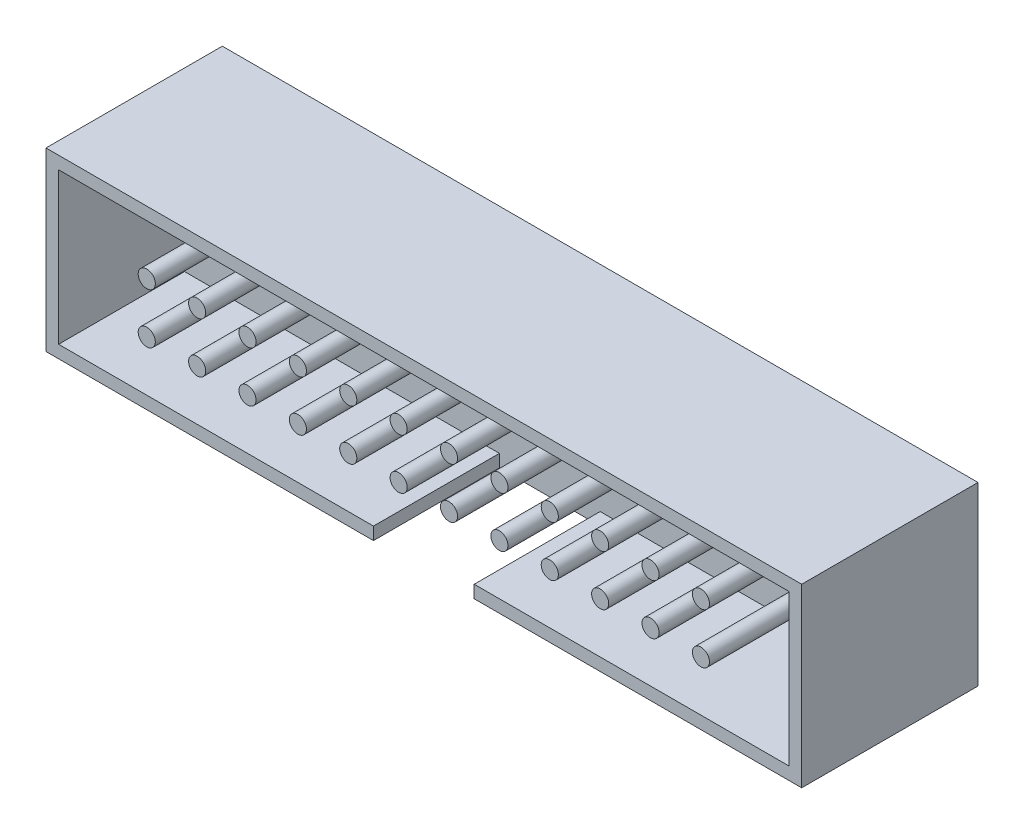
ISO-10303-21;
HEADER;
FILE_DESCRIPTION(('STEP AP214'),'2;1');
FILE_NAME('part.step','',(''),(''),'','','');
FILE_SCHEMA(('AUTOMOTIVE_DESIGN { 1 0 10303 214 1 1 1 1 }'));
ENDSEC;
DATA;
#1=APPLICATION_CONTEXT('core data for automotive mechanical design processes');
#2=APPLICATION_PROTOCOL_DEFINITION('international standard','automotive_design',2000,#1);
#3=PRODUCT_CONTEXT('',#1,'mechanical');
#4=PRODUCT('Part','Part','',(#3));
#5=PRODUCT_RELATED_PRODUCT_CATEGORY('part','',(#4));
#6=PRODUCT_DEFINITION_FORMATION('','',#4);
#7=PRODUCT_DEFINITION_CONTEXT('part definition',#1,'design');
#8=PRODUCT_DEFINITION('design','',#6,#7);
#9=PRODUCT_DEFINITION_SHAPE('','',#8);
#10=(LENGTH_UNIT() NAMED_UNIT(*) SI_UNIT(.MILLI.,.METRE.));
#11=(NAMED_UNIT(*) PLANE_ANGLE_UNIT() SI_UNIT($,.RADIAN.));
#12=(NAMED_UNIT(*) SI_UNIT($,.STERADIAN.) SOLID_ANGLE_UNIT());
#13=UNCERTAINTY_MEASURE_WITH_UNIT(LENGTH_MEASURE(1.E-05),#10,'distance_accuracy_value','');
#14=(GEOMETRIC_REPRESENTATION_CONTEXT(3) GLOBAL_UNCERTAINTY_ASSIGNED_CONTEXT((#13)) GLOBAL_UNIT_ASSIGNED_CONTEXT((#10,
#11,#12)) REPRESENTATION_CONTEXT('',''));
#15=CARTESIAN_POINT('',(0.,0.,0.));
#16=DIRECTION('',(0.,0.,1.));
#17=DIRECTION('',(1.,0.,0.));
#18=AXIS2_PLACEMENT_3D('',#15,#16,#17);
#19=CARTESIAN_POINT('',(27.94,2.54,8.89));
#20=DIRECTION('',(0.,0.,-1.));
#21=DIRECTION('',(-1.,0.,0.));
#22=AXIS2_PLACEMENT_3D('',#19,#20,#21);
#23=CYLINDRICAL_SURFACE('',#22,0.4318);
#24=CARTESIAN_POINT('',(27.94,2.54,8.89));
#25=DIRECTION('',(0.,0.,-1.));
#26=DIRECTION('',(-1.,0.,0.));
#27=AXIS2_PLACEMENT_3D('',#24,#25,#26);
#28=CIRCLE('',#27,0.4318);
#29=CARTESIAN_POINT('',(27.5082,2.54,8.89));
#30=VERTEX_POINT('',#29);
#31=EDGE_CURVE('E11',#30,#30,#28,.T.);
#32=ORIENTED_EDGE('',*,*,#31,.T.);
#33=EDGE_LOOP('',(#32));
#34=FACE_BOUND('',#33,.T.);
#35=CARTESIAN_POINT('',(27.94,2.54,-2.54));
#36=DIRECTION('',(0.,0.,-1.));
#37=DIRECTION('',(-1.,0.,0.));
#38=AXIS2_PLACEMENT_3D('',#35,#36,#37);
#39=CIRCLE('',#38,0.4318);
#40=CARTESIAN_POINT('',(27.5082,2.54,-2.54));
#41=VERTEX_POINT('',#40);
#42=EDGE_CURVE('E46',#41,#41,#39,.T.);
#43=ORIENTED_EDGE('',*,*,#42,.F.);
#44=EDGE_LOOP('',(#43));
#45=FACE_BOUND('',#44,.T.);
#46=ADVANCED_FACE('F40',(#34,#45),#23,.T.);
#47=CARTESIAN_POINT('',(27.94,2.54,8.89));
#48=DIRECTION('',(0.,0.,-1.));
#49=DIRECTION('',(-1.,0.,0.));
#50=AXIS2_PLACEMENT_3D('',#47,#48,#49);
#51=PLANE('',#50);
#52=ORIENTED_EDGE('',*,*,#31,.F.);
#53=EDGE_LOOP('',(#52));
#54=FACE_BOUND('',#53,.T.);
#55=ADVANCED_FACE('F55',(#54),#51,.F.);
#56=CARTESIAN_POINT('',(27.94,2.54,-2.54));
#57=DIRECTION('',(0.,0.,-1.));
#58=DIRECTION('',(-1.,0.,0.));
#59=AXIS2_PLACEMENT_3D('',#56,#57,#58);
#60=PLANE('',#59);
#61=ORIENTED_EDGE('',*,*,#42,.T.);
#62=EDGE_LOOP('',(#61));
#63=FACE_BOUND('',#62,.T.);
#64=ADVANCED_FACE('F52',(#63),#60,.T.);
#65=CLOSED_SHELL('',(#46,#55,#64));
#66=MANIFOLD_SOLID_BREP('B2',#65);
#67=CARTESIAN_POINT('',(25.4,2.54,8.89));
#68=DIRECTION('',(0.,0.,-1.));
#69=DIRECTION('',(-1.,0.,0.));
#70=AXIS2_PLACEMENT_3D('',#67,#68,#69);
#71=CYLINDRICAL_SURFACE('',#70,0.4318);
#72=CARTESIAN_POINT('',(25.4,2.54,8.89));
#73=DIRECTION('',(0.,0.,-1.));
#74=DIRECTION('',(-1.,0.,0.));
#75=AXIS2_PLACEMENT_3D('',#72,#73,#74);
#76=CIRCLE('',#75,0.4318);
#77=CARTESIAN_POINT('',(24.9682,2.54,8.89));
#78=VERTEX_POINT('',#77);
#79=EDGE_CURVE('E39',#78,#78,#76,.T.);
#80=ORIENTED_EDGE('',*,*,#79,.T.);
#81=EDGE_LOOP('',(#80));
#82=FACE_BOUND('',#81,.T.);
#83=CARTESIAN_POINT('',(25.4,2.54,-2.54));
#84=DIRECTION('',(0.,0.,-1.));
#85=DIRECTION('',(-1.,0.,0.));
#86=AXIS2_PLACEMENT_3D('',#83,#84,#85);
#87=CIRCLE('',#86,0.4318);
#88=CARTESIAN_POINT('',(24.9682,2.54,-2.54));
#89=VERTEX_POINT('',#88);
#90=EDGE_CURVE('E95',#89,#89,#87,.T.);
#91=ORIENTED_EDGE('',*,*,#90,.F.);
#92=EDGE_LOOP('',(#91));
#93=FACE_BOUND('',#92,.T.);
#94=ADVANCED_FACE('F89',(#82,#93),#71,.T.);
#95=CARTESIAN_POINT('',(25.4,2.54,8.89));
#96=DIRECTION('',(0.,0.,-1.));
#97=DIRECTION('',(-1.,0.,0.));
#98=AXIS2_PLACEMENT_3D('',#95,#96,#97);
#99=PLANE('',#98);
#100=ORIENTED_EDGE('',*,*,#79,.F.);
#101=EDGE_LOOP('',(#100));
#102=FACE_BOUND('',#101,.T.);
#103=ADVANCED_FACE('F104',(#102),#99,.F.);
#104=CARTESIAN_POINT('',(25.4,2.54,-2.54));
#105=DIRECTION('',(0.,0.,-1.));
#106=DIRECTION('',(-1.,0.,0.));
#107=AXIS2_PLACEMENT_3D('',#104,#105,#106);
#108=PLANE('',#107);
#109=ORIENTED_EDGE('',*,*,#90,.T.);
#110=EDGE_LOOP('',(#109));
#111=FACE_BOUND('',#110,.T.);
#112=ADVANCED_FACE('F101',(#111),#108,.T.);
#113=CLOSED_SHELL('',(#94,#103,#112));
#114=MANIFOLD_SOLID_BREP('B6',#113);
#115=CARTESIAN_POINT('',(22.86,2.54,8.89));
#116=DIRECTION('',(0.,0.,-1.));
#117=DIRECTION('',(-1.,0.,0.));
#118=AXIS2_PLACEMENT_3D('',#115,#116,#117);
#119=CYLINDRICAL_SURFACE('',#118,0.4318);
#120=CARTESIAN_POINT('',(22.86,2.54,8.89));
#121=DIRECTION('',(0.,0.,-1.));
#122=DIRECTION('',(-1.,0.,0.));
#123=AXIS2_PLACEMENT_3D('',#120,#121,#122);
#124=CIRCLE('',#123,0.4318);
#125=CARTESIAN_POINT('',(22.4282,2.54,8.89));
#126=VERTEX_POINT('',#125);
#127=EDGE_CURVE('E88',#126,#126,#124,.T.);
#128=ORIENTED_EDGE('',*,*,#127,.T.);
#129=EDGE_LOOP('',(#128));
#130=FACE_BOUND('',#129,.T.);
#131=CARTESIAN_POINT('',(22.86,2.54,-2.54));
#132=DIRECTION('',(0.,0.,-1.));
#133=DIRECTION('',(-1.,0.,0.));
#134=AXIS2_PLACEMENT_3D('',#131,#132,#133);
#135=CIRCLE('',#134,0.4318);
#136=CARTESIAN_POINT('',(22.4282,2.54,-2.54));
#137=VERTEX_POINT('',#136);
#138=EDGE_CURVE('E144',#137,#137,#135,.T.);
#139=ORIENTED_EDGE('',*,*,#138,.F.);
#140=EDGE_LOOP('',(#139));
#141=FACE_BOUND('',#140,.T.);
#142=ADVANCED_FACE('F138',(#130,#141),#119,.T.);
#143=CARTESIAN_POINT('',(22.86,2.54,8.89));
#144=DIRECTION('',(0.,0.,-1.));
#145=DIRECTION('',(-1.,0.,0.));
#146=AXIS2_PLACEMENT_3D('',#143,#144,#145);
#147=PLANE('',#146);
#148=ORIENTED_EDGE('',*,*,#127,.F.);
#149=EDGE_LOOP('',(#148));
#150=FACE_BOUND('',#149,.T.);
#151=ADVANCED_FACE('F153',(#150),#147,.F.);
#152=CARTESIAN_POINT('',(22.86,2.54,-2.54));
#153=DIRECTION('',(0.,0.,-1.));
#154=DIRECTION('',(-1.,0.,0.));
#155=AXIS2_PLACEMENT_3D('',#152,#153,#154);
#156=PLANE('',#155);
#157=ORIENTED_EDGE('',*,*,#138,.T.);
#158=EDGE_LOOP('',(#157));
#159=FACE_BOUND('',#158,.T.);
#160=ADVANCED_FACE('F150',(#159),#156,.T.);
#161=CLOSED_SHELL('',(#142,#151,#160));
#162=MANIFOLD_SOLID_BREP('B34',#161);
#163=CARTESIAN_POINT('',(20.32,2.54,8.89));
#164=DIRECTION('',(0.,0.,-1.));
#165=DIRECTION('',(-1.,0.,0.));
#166=AXIS2_PLACEMENT_3D('',#163,#164,#165);
#167=CYLINDRICAL_SURFACE('',#166,0.4318);
#168=CARTESIAN_POINT('',(20.32,2.54,8.89));
#169=DIRECTION('',(0.,0.,-1.));
#170=DIRECTION('',(-1.,0.,0.));
#171=AXIS2_PLACEMENT_3D('',#168,#169,#170);
#172=CIRCLE('',#171,0.4318);
#173=CARTESIAN_POINT('',(19.8882,2.54,8.89));
#174=VERTEX_POINT('',#173);
#175=EDGE_CURVE('E137',#174,#174,#172,.T.);
#176=ORIENTED_EDGE('',*,*,#175,.T.);
#177=EDGE_LOOP('',(#176));
#178=FACE_BOUND('',#177,.T.);
#179=CARTESIAN_POINT('',(20.32,2.54,-2.54));
#180=DIRECTION('',(0.,0.,-1.));
#181=DIRECTION('',(-1.,0.,0.));
#182=AXIS2_PLACEMENT_3D('',#179,#180,#181);
#183=CIRCLE('',#182,0.4318);
#184=CARTESIAN_POINT('',(19.8882,2.54,-2.54));
#185=VERTEX_POINT('',#184);
#186=EDGE_CURVE('E193',#185,#185,#183,.T.);
#187=ORIENTED_EDGE('',*,*,#186,.F.);
#188=EDGE_LOOP('',(#187));
#189=FACE_BOUND('',#188,.T.);
#190=ADVANCED_FACE('F187',(#178,#189),#167,.T.);
#191=CARTESIAN_POINT('',(20.32,2.54,8.89));
#192=DIRECTION('',(0.,0.,-1.));
#193=DIRECTION('',(-1.,0.,0.));
#194=AXIS2_PLACEMENT_3D('',#191,#192,#193);
#195=PLANE('',#194);
#196=ORIENTED_EDGE('',*,*,#175,.F.);
#197=EDGE_LOOP('',(#196));
#198=FACE_BOUND('',#197,.T.);
#199=ADVANCED_FACE('F202',(#198),#195,.F.);
#200=CARTESIAN_POINT('',(20.32,2.54,-2.54));
#201=DIRECTION('',(0.,0.,-1.));
#202=DIRECTION('',(-1.,0.,0.));
#203=AXIS2_PLACEMENT_3D('',#200,#201,#202);
#204=PLANE('',#203);
#205=ORIENTED_EDGE('',*,*,#186,.T.);
#206=EDGE_LOOP('',(#205));
#207=FACE_BOUND('',#206,.T.);
#208=ADVANCED_FACE('F199',(#207),#204,.T.);
#209=CLOSED_SHELL('',(#190,#199,#208));
#210=MANIFOLD_SOLID_BREP('B83',#209);
#211=CARTESIAN_POINT('',(17.78,2.54,8.89));
#212=DIRECTION('',(0.,0.,-1.));
#213=DIRECTION('',(-1.,0.,0.));
#214=AXIS2_PLACEMENT_3D('',#211,#212,#213);
#215=CYLINDRICAL_SURFACE('',#214,0.4318);
#216=CARTESIAN_POINT('',(17.78,2.54,8.89));
#217=DIRECTION('',(0.,0.,-1.));
#218=DIRECTION('',(-1.,0.,0.));
#219=AXIS2_PLACEMENT_3D('',#216,#217,#218);
#220=CIRCLE('',#219,0.4318);
#221=CARTESIAN_POINT('',(17.3482,2.54,8.89));
#222=VERTEX_POINT('',#221);
#223=EDGE_CURVE('E186',#222,#222,#220,.T.);
#224=ORIENTED_EDGE('',*,*,#223,.T.);
#225=EDGE_LOOP('',(#224));
#226=FACE_BOUND('',#225,.T.);
#227=CARTESIAN_POINT('',(17.78,2.54,-2.54));
#228=DIRECTION('',(0.,0.,-1.));
#229=DIRECTION('',(-1.,0.,0.));
#230=AXIS2_PLACEMENT_3D('',#227,#228,#229);
#231=CIRCLE('',#230,0.4318);
#232=CARTESIAN_POINT('',(17.3482,2.54,-2.54));
#233=VERTEX_POINT('',#232);
#234=EDGE_CURVE('E242',#233,#233,#231,.T.);
#235=ORIENTED_EDGE('',*,*,#234,.F.);
#236=EDGE_LOOP('',(#235));
#237=FACE_BOUND('',#236,.T.);
#238=ADVANCED_FACE('F236',(#226,#237),#215,.T.);
#239=CARTESIAN_POINT('',(17.78,2.54,8.89));
#240=DIRECTION('',(0.,0.,-1.));
#241=DIRECTION('',(-1.,0.,0.));
#242=AXIS2_PLACEMENT_3D('',#239,#240,#241);
#243=PLANE('',#242);
#244=ORIENTED_EDGE('',*,*,#223,.F.);
#245=EDGE_LOOP('',(#244));
#246=FACE_BOUND('',#245,.T.);
#247=ADVANCED_FACE('F251',(#246),#243,.F.);
#248=CARTESIAN_POINT('',(17.78,2.54,-2.54));
#249=DIRECTION('',(0.,0.,-1.));
#250=DIRECTION('',(-1.,0.,0.));
#251=AXIS2_PLACEMENT_3D('',#248,#249,#250);
#252=PLANE('',#251);
#253=ORIENTED_EDGE('',*,*,#234,.T.);
#254=EDGE_LOOP('',(#253));
#255=FACE_BOUND('',#254,.T.);
#256=ADVANCED_FACE('F248',(#255),#252,.T.);
#257=CLOSED_SHELL('',(#238,#247,#256));
#258=MANIFOLD_SOLID_BREP('B132',#257);
#259=CARTESIAN_POINT('',(15.24,2.54,8.89));
#260=DIRECTION('',(0.,0.,-1.));
#261=DIRECTION('',(-1.,0.,0.));
#262=AXIS2_PLACEMENT_3D('',#259,#260,#261);
#263=CYLINDRICAL_SURFACE('',#262,0.4318);
#264=CARTESIAN_POINT('',(15.24,2.54,8.89));
#265=DIRECTION('',(0.,0.,-1.));
#266=DIRECTION('',(-1.,0.,0.));
#267=AXIS2_PLACEMENT_3D('',#264,#265,#266);
#268=CIRCLE('',#267,0.4318);
#269=CARTESIAN_POINT('',(14.8082,2.54,8.89));
#270=VERTEX_POINT('',#269);
#271=EDGE_CURVE('E235',#270,#270,#268,.T.);
#272=ORIENTED_EDGE('',*,*,#271,.T.);
#273=EDGE_LOOP('',(#272));
#274=FACE_BOUND('',#273,.T.);
#275=CARTESIAN_POINT('',(15.24,2.54,-2.54));
#276=DIRECTION('',(0.,0.,-1.));
#277=DIRECTION('',(-1.,0.,0.));
#278=AXIS2_PLACEMENT_3D('',#275,#276,#277);
#279=CIRCLE('',#278,0.4318);
#280=CARTESIAN_POINT('',(14.8082,2.54,-2.54));
#281=VERTEX_POINT('',#280);
#282=EDGE_CURVE('E291',#281,#281,#279,.T.);
#283=ORIENTED_EDGE('',*,*,#282,.F.);
#284=EDGE_LOOP('',(#283));
#285=FACE_BOUND('',#284,.T.);
#286=ADVANCED_FACE('F285',(#274,#285),#263,.T.);
#287=CARTESIAN_POINT('',(15.24,2.54,8.89));
#288=DIRECTION('',(0.,0.,-1.));
#289=DIRECTION('',(-1.,0.,0.));
#290=AXIS2_PLACEMENT_3D('',#287,#288,#289);
#291=PLANE('',#290);
#292=ORIENTED_EDGE('',*,*,#271,.F.);
#293=EDGE_LOOP('',(#292));
#294=FACE_BOUND('',#293,.T.);
#295=ADVANCED_FACE('F300',(#294),#291,.F.);
#296=CARTESIAN_POINT('',(15.24,2.54,-2.54));
#297=DIRECTION('',(0.,0.,-1.));
#298=DIRECTION('',(-1.,0.,0.));
#299=AXIS2_PLACEMENT_3D('',#296,#297,#298);
#300=PLANE('',#299);
#301=ORIENTED_EDGE('',*,*,#282,.T.);
#302=EDGE_LOOP('',(#301));
#303=FACE_BOUND('',#302,.T.);
#304=ADVANCED_FACE('F297',(#303),#300,.T.);
#305=CLOSED_SHELL('',(#286,#295,#304));
#306=MANIFOLD_SOLID_BREP('B181',#305);
#307=CARTESIAN_POINT('',(12.7,2.54,8.89));
#308=DIRECTION('',(0.,0.,-1.));
#309=DIRECTION('',(-1.,0.,0.));
#310=AXIS2_PLACEMENT_3D('',#307,#308,#309);
#311=CYLINDRICAL_SURFACE('',#310,0.4318);
#312=CARTESIAN_POINT('',(12.7,2.54,8.89));
#313=DIRECTION('',(0.,0.,-1.));
#314=DIRECTION('',(-1.,0.,0.));
#315=AXIS2_PLACEMENT_3D('',#312,#313,#314);
#316=CIRCLE('',#315,0.4318);
#317=CARTESIAN_POINT('',(12.2682,2.54,8.89));
#318=VERTEX_POINT('',#317);
#319=EDGE_CURVE('E284',#318,#318,#316,.T.);
#320=ORIENTED_EDGE('',*,*,#319,.T.);
#321=EDGE_LOOP('',(#320));
#322=FACE_BOUND('',#321,.T.);
#323=CARTESIAN_POINT('',(12.7,2.54,-2.54));
#324=DIRECTION('',(0.,0.,-1.));
#325=DIRECTION('',(-1.,0.,0.));
#326=AXIS2_PLACEMENT_3D('',#323,#324,#325);
#327=CIRCLE('',#326,0.4318);
#328=CARTESIAN_POINT('',(12.2682,2.54,-2.54));
#329=VERTEX_POINT('',#328);
#330=EDGE_CURVE('E340',#329,#329,#327,.T.);
#331=ORIENTED_EDGE('',*,*,#330,.F.);
#332=EDGE_LOOP('',(#331));
#333=FACE_BOUND('',#332,.T.);
#334=ADVANCED_FACE('F334',(#322,#333),#311,.T.);
#335=CARTESIAN_POINT('',(12.7,2.54,8.89));
#336=DIRECTION('',(0.,0.,-1.));
#337=DIRECTION('',(-1.,0.,0.));
#338=AXIS2_PLACEMENT_3D('',#335,#336,#337);
#339=PLANE('',#338);
#340=ORIENTED_EDGE('',*,*,#319,.F.);
#341=EDGE_LOOP('',(#340));
#342=FACE_BOUND('',#341,.T.);
#343=ADVANCED_FACE('F349',(#342),#339,.F.);
#344=CARTESIAN_POINT('',(12.7,2.54,-2.54));
#345=DIRECTION('',(0.,0.,-1.));
#346=DIRECTION('',(-1.,0.,0.));
#347=AXIS2_PLACEMENT_3D('',#344,#345,#346);
#348=PLANE('',#347);
#349=ORIENTED_EDGE('',*,*,#330,.T.);
#350=EDGE_LOOP('',(#349));
#351=FACE_BOUND('',#350,.T.);
#352=ADVANCED_FACE('F346',(#351),#348,.T.);
#353=CLOSED_SHELL('',(#334,#343,#352));
#354=MANIFOLD_SOLID_BREP('B230',#353);
#355=CARTESIAN_POINT('',(10.16,2.54,8.89));
#356=DIRECTION('',(0.,0.,-1.));
#357=DIRECTION('',(-1.,0.,0.));
#358=AXIS2_PLACEMENT_3D('',#355,#356,#357);
#359=CYLINDRICAL_SURFACE('',#358,0.4318);
#360=CARTESIAN_POINT('',(10.16,2.54,8.89));
#361=DIRECTION('',(0.,0.,-1.));
#362=DIRECTION('',(-1.,0.,0.));
#363=AXIS2_PLACEMENT_3D('',#360,#361,#362);
#364=CIRCLE('',#363,0.4318);
#365=CARTESIAN_POINT('',(9.7282,2.54,8.89));
#366=VERTEX_POINT('',#365);
#367=EDGE_CURVE('E333',#366,#366,#364,.T.);
#368=ORIENTED_EDGE('',*,*,#367,.T.);
#369=EDGE_LOOP('',(#368));
#370=FACE_BOUND('',#369,.T.);
#371=CARTESIAN_POINT('',(10.16,2.54,-2.54));
#372=DIRECTION('',(0.,0.,-1.));
#373=DIRECTION('',(-1.,0.,0.));
#374=AXIS2_PLACEMENT_3D('',#371,#372,#373);
#375=CIRCLE('',#374,0.4318);
#376=CARTESIAN_POINT('',(9.7282,2.54,-2.54));
#377=VERTEX_POINT('',#376);
#378=EDGE_CURVE('E389',#377,#377,#375,.T.);
#379=ORIENTED_EDGE('',*,*,#378,.F.);
#380=EDGE_LOOP('',(#379));
#381=FACE_BOUND('',#380,.T.);
#382=ADVANCED_FACE('F383',(#370,#381),#359,.T.);
#383=CARTESIAN_POINT('',(10.16,2.54,8.89));
#384=DIRECTION('',(0.,0.,-1.));
#385=DIRECTION('',(-1.,0.,0.));
#386=AXIS2_PLACEMENT_3D('',#383,#384,#385);
#387=PLANE('',#386);
#388=ORIENTED_EDGE('',*,*,#367,.F.);
#389=EDGE_LOOP('',(#388));
#390=FACE_BOUND('',#389,.T.);
#391=ADVANCED_FACE('F398',(#390),#387,.F.);
#392=CARTESIAN_POINT('',(10.16,2.54,-2.54));
#393=DIRECTION('',(0.,0.,-1.));
#394=DIRECTION('',(-1.,0.,0.));
#395=AXIS2_PLACEMENT_3D('',#392,#393,#394);
#396=PLANE('',#395);
#397=ORIENTED_EDGE('',*,*,#378,.T.);
#398=EDGE_LOOP('',(#397));
#399=FACE_BOUND('',#398,.T.);
#400=ADVANCED_FACE('F395',(#399),#396,.T.);
#401=CLOSED_SHELL('',(#382,#391,#400));
#402=MANIFOLD_SOLID_BREP('B279',#401);
#403=CARTESIAN_POINT('',(7.62,2.54,8.89));
#404=DIRECTION('',(0.,0.,-1.));
#405=DIRECTION('',(-1.,0.,0.));
#406=AXIS2_PLACEMENT_3D('',#403,#404,#405);
#407=CYLINDRICAL_SURFACE('',#406,0.4318);
#408=CARTESIAN_POINT('',(7.62,2.54,8.89));
#409=DIRECTION('',(0.,0.,-1.));
#410=DIRECTION('',(-1.,0.,0.));
#411=AXIS2_PLACEMENT_3D('',#408,#409,#410);
#412=CIRCLE('',#411,0.4318);
#413=CARTESIAN_POINT('',(7.1882,2.54,8.89));
#414=VERTEX_POINT('',#413);
#415=EDGE_CURVE('E382',#414,#414,#412,.T.);
#416=ORIENTED_EDGE('',*,*,#415,.T.);
#417=EDGE_LOOP('',(#416));
#418=FACE_BOUND('',#417,.T.);
#419=CARTESIAN_POINT('',(7.62,2.54,-2.54));
#420=DIRECTION('',(0.,0.,-1.));
#421=DIRECTION('',(-1.,0.,0.));
#422=AXIS2_PLACEMENT_3D('',#419,#420,#421);
#423=CIRCLE('',#422,0.4318);
#424=CARTESIAN_POINT('',(7.1882,2.54,-2.54));
#425=VERTEX_POINT('',#424);
#426=EDGE_CURVE('E438',#425,#425,#423,.T.);
#427=ORIENTED_EDGE('',*,*,#426,.F.);
#428=EDGE_LOOP('',(#427));
#429=FACE_BOUND('',#428,.T.);
#430=ADVANCED_FACE('F432',(#418,#429),#407,.T.);
#431=CARTESIAN_POINT('',(7.62,2.54,8.89));
#432=DIRECTION('',(0.,0.,-1.));
#433=DIRECTION('',(-1.,0.,0.));
#434=AXIS2_PLACEMENT_3D('',#431,#432,#433);
#435=PLANE('',#434);
#436=ORIENTED_EDGE('',*,*,#415,.F.);
#437=EDGE_LOOP('',(#436));
#438=FACE_BOUND('',#437,.T.);
#439=ADVANCED_FACE('F447',(#438),#435,.F.);
#440=CARTESIAN_POINT('',(7.62,2.54,-2.54));
#441=DIRECTION('',(0.,0.,-1.));
#442=DIRECTION('',(-1.,0.,0.));
#443=AXIS2_PLACEMENT_3D('',#440,#441,#442);
#444=PLANE('',#443);
#445=ORIENTED_EDGE('',*,*,#426,.T.);
#446=EDGE_LOOP('',(#445));
#447=FACE_BOUND('',#446,.T.);
#448=ADVANCED_FACE('F444',(#447),#444,.T.);
#449=CLOSED_SHELL('',(#430,#439,#448));
#450=MANIFOLD_SOLID_BREP('B328',#449);
#451=CARTESIAN_POINT('',(5.08,2.54,8.89));
#452=DIRECTION('',(0.,0.,-1.));
#453=DIRECTION('',(-1.,0.,0.));
#454=AXIS2_PLACEMENT_3D('',#451,#452,#453);
#455=CYLINDRICAL_SURFACE('',#454,0.4318);
#456=CARTESIAN_POINT('',(5.08,2.54,8.89));
#457=DIRECTION('',(0.,0.,-1.));
#458=DIRECTION('',(-1.,0.,0.));
#459=AXIS2_PLACEMENT_3D('',#456,#457,#458);
#460=CIRCLE('',#459,0.4318);
#461=CARTESIAN_POINT('',(4.6482,2.54,8.89));
#462=VERTEX_POINT('',#461);
#463=EDGE_CURVE('E431',#462,#462,#460,.T.);
#464=ORIENTED_EDGE('',*,*,#463,.T.);
#465=EDGE_LOOP('',(#464));
#466=FACE_BOUND('',#465,.T.);
#467=CARTESIAN_POINT('',(5.08,2.54,-2.54));
#468=DIRECTION('',(0.,0.,-1.));
#469=DIRECTION('',(-1.,0.,0.));
#470=AXIS2_PLACEMENT_3D('',#467,#468,#469);
#471=CIRCLE('',#470,0.4318);
#472=CARTESIAN_POINT('',(4.6482,2.54,-2.54));
#473=VERTEX_POINT('',#472);
#474=EDGE_CURVE('E487',#473,#473,#471,.T.);
#475=ORIENTED_EDGE('',*,*,#474,.F.);
#476=EDGE_LOOP('',(#475));
#477=FACE_BOUND('',#476,.T.);
#478=ADVANCED_FACE('F481',(#466,#477),#455,.T.);
#479=CARTESIAN_POINT('',(5.08,2.54,8.89));
#480=DIRECTION('',(0.,0.,-1.));
#481=DIRECTION('',(-1.,0.,0.));
#482=AXIS2_PLACEMENT_3D('',#479,#480,#481);
#483=PLANE('',#482);
#484=ORIENTED_EDGE('',*,*,#463,.F.);
#485=EDGE_LOOP('',(#484));
#486=FACE_BOUND('',#485,.T.);
#487=ADVANCED_FACE('F496',(#486),#483,.F.);
#488=CARTESIAN_POINT('',(5.08,2.54,-2.54));
#489=DIRECTION('',(0.,0.,-1.));
#490=DIRECTION('',(-1.,0.,0.));
#491=AXIS2_PLACEMENT_3D('',#488,#489,#490);
#492=PLANE('',#491);
#493=ORIENTED_EDGE('',*,*,#474,.T.);
#494=EDGE_LOOP('',(#493));
#495=FACE_BOUND('',#494,.T.);
#496=ADVANCED_FACE('F493',(#495),#492,.T.);
#497=CLOSED_SHELL('',(#478,#487,#496));
#498=MANIFOLD_SOLID_BREP('B377',#497);
#499=CARTESIAN_POINT('',(2.54,2.54,8.89));
#500=DIRECTION('',(0.,0.,-1.));
#501=DIRECTION('',(-1.,0.,0.));
#502=AXIS2_PLACEMENT_3D('',#499,#500,#501);
#503=CYLINDRICAL_SURFACE('',#502,0.4318);
#504=CARTESIAN_POINT('',(2.54,2.54,8.89));
#505=DIRECTION('',(0.,0.,-1.));
#506=DIRECTION('',(-1.,0.,0.));
#507=AXIS2_PLACEMENT_3D('',#504,#505,#506);
#508=CIRCLE('',#507,0.4318);
#509=CARTESIAN_POINT('',(2.1082,2.54,8.89));
#510=VERTEX_POINT('',#509);
#511=EDGE_CURVE('E480',#510,#510,#508,.T.);
#512=ORIENTED_EDGE('',*,*,#511,.T.);
#513=EDGE_LOOP('',(#512));
#514=FACE_BOUND('',#513,.T.);
#515=CARTESIAN_POINT('',(2.54,2.54,-2.54));
#516=DIRECTION('',(0.,0.,-1.));
#517=DIRECTION('',(-1.,0.,0.));
#518=AXIS2_PLACEMENT_3D('',#515,#516,#517);
#519=CIRCLE('',#518,0.4318);
#520=CARTESIAN_POINT('',(2.1082,2.54,-2.54));
#521=VERTEX_POINT('',#520);
#522=EDGE_CURVE('E536',#521,#521,#519,.T.);
#523=ORIENTED_EDGE('',*,*,#522,.F.);
#524=EDGE_LOOP('',(#523));
#525=FACE_BOUND('',#524,.T.);
#526=ADVANCED_FACE('F530',(#514,#525),#503,.T.);
#527=CARTESIAN_POINT('',(2.54,2.54,8.89));
#528=DIRECTION('',(0.,0.,-1.));
#529=DIRECTION('',(-1.,0.,0.));
#530=AXIS2_PLACEMENT_3D('',#527,#528,#529);
#531=PLANE('',#530);
#532=ORIENTED_EDGE('',*,*,#511,.F.);
#533=EDGE_LOOP('',(#532));
#534=FACE_BOUND('',#533,.T.);
#535=ADVANCED_FACE('F545',(#534),#531,.F.);
#536=CARTESIAN_POINT('',(2.54,2.54,-2.54));
#537=DIRECTION('',(0.,0.,-1.));
#538=DIRECTION('',(-1.,0.,0.));
#539=AXIS2_PLACEMENT_3D('',#536,#537,#538);
#540=PLANE('',#539);
#541=ORIENTED_EDGE('',*,*,#522,.T.);
#542=EDGE_LOOP('',(#541));
#543=FACE_BOUND('',#542,.T.);
#544=ADVANCED_FACE('F542',(#543),#540,.T.);
#545=CLOSED_SHELL('',(#526,#535,#544));
#546=MANIFOLD_SOLID_BREP('B426',#545);
#547=CARTESIAN_POINT('',(27.94,0.,8.89));
#548=DIRECTION('',(0.,0.,-1.));
#549=DIRECTION('',(-1.,0.,0.));
#550=AXIS2_PLACEMENT_3D('',#547,#548,#549);
#551=CYLINDRICAL_SURFACE('',#550,0.4318);
#552=CARTESIAN_POINT('',(27.94,0.,8.89));
#553=DIRECTION('',(0.,0.,-1.));
#554=DIRECTION('',(-1.,0.,0.));
#555=AXIS2_PLACEMENT_3D('',#552,#553,#554);
#556=CIRCLE('',#555,0.4318);
#557=CARTESIAN_POINT('',(27.5082,0.,8.89));
#558=VERTEX_POINT('',#557);
#559=EDGE_CURVE('E529',#558,#558,#556,.T.);
#560=ORIENTED_EDGE('',*,*,#559,.T.);
#561=EDGE_LOOP('',(#560));
#562=FACE_BOUND('',#561,.T.);
#563=CARTESIAN_POINT('',(27.94,0.,-2.54));
#564=DIRECTION('',(0.,0.,-1.));
#565=DIRECTION('',(-1.,0.,0.));
#566=AXIS2_PLACEMENT_3D('',#563,#564,#565);
#567=CIRCLE('',#566,0.4318);
#568=CARTESIAN_POINT('',(27.5082,0.,-2.54));
#569=VERTEX_POINT('',#568);
#570=EDGE_CURVE('E585',#569,#569,#567,.T.);
#571=ORIENTED_EDGE('',*,*,#570,.F.);
#572=EDGE_LOOP('',(#571));
#573=FACE_BOUND('',#572,.T.);
#574=ADVANCED_FACE('F579',(#562,#573),#551,.T.);
#575=CARTESIAN_POINT('',(27.94,0.,8.89));
#576=DIRECTION('',(0.,0.,-1.));
#577=DIRECTION('',(-1.,0.,0.));
#578=AXIS2_PLACEMENT_3D('',#575,#576,#577);
#579=PLANE('',#578);
#580=ORIENTED_EDGE('',*,*,#559,.F.);
#581=EDGE_LOOP('',(#580));
#582=FACE_BOUND('',#581,.T.);
#583=ADVANCED_FACE('F594',(#582),#579,.F.);
#584=CARTESIAN_POINT('',(27.94,0.,-2.54));
#585=DIRECTION('',(0.,0.,-1.));
#586=DIRECTION('',(-1.,0.,0.));
#587=AXIS2_PLACEMENT_3D('',#584,#585,#586);
#588=PLANE('',#587);
#589=ORIENTED_EDGE('',*,*,#570,.T.);
#590=EDGE_LOOP('',(#589));
#591=FACE_BOUND('',#590,.T.);
#592=ADVANCED_FACE('F591',(#591),#588,.T.);
#593=CLOSED_SHELL('',(#574,#583,#592));
#594=MANIFOLD_SOLID_BREP('B475',#593);
#595=CARTESIAN_POINT('',(25.4,0.,8.89));
#596=DIRECTION('',(0.,0.,-1.));
#597=DIRECTION('',(-1.,0.,0.));
#598=AXIS2_PLACEMENT_3D('',#595,#596,#597);
#599=CYLINDRICAL_SURFACE('',#598,0.4318);
#600=CARTESIAN_POINT('',(25.4,0.,8.89));
#601=DIRECTION('',(0.,0.,-1.));
#602=DIRECTION('',(-1.,0.,0.));
#603=AXIS2_PLACEMENT_3D('',#600,#601,#602);
#604=CIRCLE('',#603,0.4318);
#605=CARTESIAN_POINT('',(24.9682,0.,8.89));
#606=VERTEX_POINT('',#605);
#607=EDGE_CURVE('E578',#606,#606,#604,.T.);
#608=ORIENTED_EDGE('',*,*,#607,.T.);
#609=EDGE_LOOP('',(#608));
#610=FACE_BOUND('',#609,.T.);
#611=CARTESIAN_POINT('',(25.4,0.,-2.54));
#612=DIRECTION('',(0.,0.,-1.));
#613=DIRECTION('',(-1.,0.,0.));
#614=AXIS2_PLACEMENT_3D('',#611,#612,#613);
#615=CIRCLE('',#614,0.4318);
#616=CARTESIAN_POINT('',(24.9682,0.,-2.54));
#617=VERTEX_POINT('',#616);
#618=EDGE_CURVE('E634',#617,#617,#615,.T.);
#619=ORIENTED_EDGE('',*,*,#618,.F.);
#620=EDGE_LOOP('',(#619));
#621=FACE_BOUND('',#620,.T.);
#622=ADVANCED_FACE('F628',(#610,#621),#599,.T.);
#623=CARTESIAN_POINT('',(25.4,0.,8.89));
#624=DIRECTION('',(0.,0.,-1.));
#625=DIRECTION('',(-1.,0.,0.));
#626=AXIS2_PLACEMENT_3D('',#623,#624,#625);
#627=PLANE('',#626);
#628=ORIENTED_EDGE('',*,*,#607,.F.);
#629=EDGE_LOOP('',(#628));
#630=FACE_BOUND('',#629,.T.);
#631=ADVANCED_FACE('F643',(#630),#627,.F.);
#632=CARTESIAN_POINT('',(25.4,0.,-2.54));
#633=DIRECTION('',(0.,0.,-1.));
#634=DIRECTION('',(-1.,0.,0.));
#635=AXIS2_PLACEMENT_3D('',#632,#633,#634);
#636=PLANE('',#635);
#637=ORIENTED_EDGE('',*,*,#618,.T.);
#638=EDGE_LOOP('',(#637));
#639=FACE_BOUND('',#638,.T.);
#640=ADVANCED_FACE('F640',(#639),#636,.T.);
#641=CLOSED_SHELL('',(#622,#631,#640));
#642=MANIFOLD_SOLID_BREP('B524',#641);
#643=CARTESIAN_POINT('',(22.86,0.,8.89));
#644=DIRECTION('',(0.,0.,-1.));
#645=DIRECTION('',(-1.,0.,0.));
#646=AXIS2_PLACEMENT_3D('',#643,#644,#645);
#647=CYLINDRICAL_SURFACE('',#646,0.4318);
#648=CARTESIAN_POINT('',(22.86,0.,8.89));
#649=DIRECTION('',(0.,0.,-1.));
#650=DIRECTION('',(-1.,0.,0.));
#651=AXIS2_PLACEMENT_3D('',#648,#649,#650);
#652=CIRCLE('',#651,0.4318);
#653=CARTESIAN_POINT('',(22.4282,0.,8.89));
#654=VERTEX_POINT('',#653);
#655=EDGE_CURVE('E627',#654,#654,#652,.T.);
#656=ORIENTED_EDGE('',*,*,#655,.T.);
#657=EDGE_LOOP('',(#656));
#658=FACE_BOUND('',#657,.T.);
#659=CARTESIAN_POINT('',(22.86,0.,-2.54));
#660=DIRECTION('',(0.,0.,-1.));
#661=DIRECTION('',(-1.,0.,0.));
#662=AXIS2_PLACEMENT_3D('',#659,#660,#661);
#663=CIRCLE('',#662,0.4318);
#664=CARTESIAN_POINT('',(22.4282,0.,-2.54));
#665=VERTEX_POINT('',#664);
#666=EDGE_CURVE('E683',#665,#665,#663,.T.);
#667=ORIENTED_EDGE('',*,*,#666,.F.);
#668=EDGE_LOOP('',(#667));
#669=FACE_BOUND('',#668,.T.);
#670=ADVANCED_FACE('F677',(#658,#669),#647,.T.);
#671=CARTESIAN_POINT('',(22.86,0.,8.89));
#672=DIRECTION('',(0.,0.,-1.));
#673=DIRECTION('',(-1.,0.,0.));
#674=AXIS2_PLACEMENT_3D('',#671,#672,#673);
#675=PLANE('',#674);
#676=ORIENTED_EDGE('',*,*,#655,.F.);
#677=EDGE_LOOP('',(#676));
#678=FACE_BOUND('',#677,.T.);
#679=ADVANCED_FACE('F692',(#678),#675,.F.);
#680=CARTESIAN_POINT('',(22.86,0.,-2.54));
#681=DIRECTION('',(0.,0.,-1.));
#682=DIRECTION('',(-1.,0.,0.));
#683=AXIS2_PLACEMENT_3D('',#680,#681,#682);
#684=PLANE('',#683);
#685=ORIENTED_EDGE('',*,*,#666,.T.);
#686=EDGE_LOOP('',(#685));
#687=FACE_BOUND('',#686,.T.);
#688=ADVANCED_FACE('F689',(#687),#684,.T.);
#689=CLOSED_SHELL('',(#670,#679,#688));
#690=MANIFOLD_SOLID_BREP('B573',#689);
#691=CARTESIAN_POINT('',(20.32,0.,8.89));
#692=DIRECTION('',(0.,0.,-1.));
#693=DIRECTION('',(-1.,0.,0.));
#694=AXIS2_PLACEMENT_3D('',#691,#692,#693);
#695=CYLINDRICAL_SURFACE('',#694,0.4318);
#696=CARTESIAN_POINT('',(20.32,0.,8.89));
#697=DIRECTION('',(0.,0.,-1.));
#698=DIRECTION('',(-1.,0.,0.));
#699=AXIS2_PLACEMENT_3D('',#696,#697,#698);
#700=CIRCLE('',#699,0.4318);
#701=CARTESIAN_POINT('',(19.8882,0.,8.89));
#702=VERTEX_POINT('',#701);
#703=EDGE_CURVE('E676',#702,#702,#700,.T.);
#704=ORIENTED_EDGE('',*,*,#703,.T.);
#705=EDGE_LOOP('',(#704));
#706=FACE_BOUND('',#705,.T.);
#707=CARTESIAN_POINT('',(20.32,0.,-2.54));
#708=DIRECTION('',(0.,0.,-1.));
#709=DIRECTION('',(-1.,0.,0.));
#710=AXIS2_PLACEMENT_3D('',#707,#708,#709);
#711=CIRCLE('',#710,0.4318);
#712=CARTESIAN_POINT('',(19.8882,0.,-2.54));
#713=VERTEX_POINT('',#712);
#714=EDGE_CURVE('E732',#713,#713,#711,.T.);
#715=ORIENTED_EDGE('',*,*,#714,.F.);
#716=EDGE_LOOP('',(#715));
#717=FACE_BOUND('',#716,.T.);
#718=ADVANCED_FACE('F726',(#706,#717),#695,.T.);
#719=CARTESIAN_POINT('',(20.32,0.,8.89));
#720=DIRECTION('',(0.,0.,-1.));
#721=DIRECTION('',(-1.,0.,0.));
#722=AXIS2_PLACEMENT_3D('',#719,#720,#721);
#723=PLANE('',#722);
#724=ORIENTED_EDGE('',*,*,#703,.F.);
#725=EDGE_LOOP('',(#724));
#726=FACE_BOUND('',#725,.T.);
#727=ADVANCED_FACE('F741',(#726),#723,.F.);
#728=CARTESIAN_POINT('',(20.32,0.,-2.54));
#729=DIRECTION('',(0.,0.,-1.));
#730=DIRECTION('',(-1.,0.,0.));
#731=AXIS2_PLACEMENT_3D('',#728,#729,#730);
#732=PLANE('',#731);
#733=ORIENTED_EDGE('',*,*,#714,.T.);
#734=EDGE_LOOP('',(#733));
#735=FACE_BOUND('',#734,.T.);
#736=ADVANCED_FACE('F738',(#735),#732,.T.);
#737=CLOSED_SHELL('',(#718,#727,#736));
#738=MANIFOLD_SOLID_BREP('B622',#737);
#739=CARTESIAN_POINT('',(17.78,0.,8.89));
#740=DIRECTION('',(0.,0.,-1.));
#741=DIRECTION('',(-1.,0.,0.));
#742=AXIS2_PLACEMENT_3D('',#739,#740,#741);
#743=CYLINDRICAL_SURFACE('',#742,0.4318);
#744=CARTESIAN_POINT('',(17.78,0.,8.89));
#745=DIRECTION('',(0.,0.,-1.));
#746=DIRECTION('',(-1.,0.,0.));
#747=AXIS2_PLACEMENT_3D('',#744,#745,#746);
#748=CIRCLE('',#747,0.4318);
#749=CARTESIAN_POINT('',(17.3482,0.,8.89));
#750=VERTEX_POINT('',#749);
#751=EDGE_CURVE('E725',#750,#750,#748,.T.);
#752=ORIENTED_EDGE('',*,*,#751,.T.);
#753=EDGE_LOOP('',(#752));
#754=FACE_BOUND('',#753,.T.);
#755=CARTESIAN_POINT('',(17.78,0.,-2.54));
#756=DIRECTION('',(0.,0.,-1.));
#757=DIRECTION('',(-1.,0.,0.));
#758=AXIS2_PLACEMENT_3D('',#755,#756,#757);
#759=CIRCLE('',#758,0.4318);
#760=CARTESIAN_POINT('',(17.3482,0.,-2.54));
#761=VERTEX_POINT('',#760);
#762=EDGE_CURVE('E781',#761,#761,#759,.T.);
#763=ORIENTED_EDGE('',*,*,#762,.F.);
#764=EDGE_LOOP('',(#763));
#765=FACE_BOUND('',#764,.T.);
#766=ADVANCED_FACE('F775',(#754,#765),#743,.T.);
#767=CARTESIAN_POINT('',(17.78,0.,8.89));
#768=DIRECTION('',(0.,0.,-1.));
#769=DIRECTION('',(-1.,0.,0.));
#770=AXIS2_PLACEMENT_3D('',#767,#768,#769);
#771=PLANE('',#770);
#772=ORIENTED_EDGE('',*,*,#751,.F.);
#773=EDGE_LOOP('',(#772));
#774=FACE_BOUND('',#773,.T.);
#775=ADVANCED_FACE('F790',(#774),#771,.F.);
#776=CARTESIAN_POINT('',(17.78,0.,-2.54));
#777=DIRECTION('',(0.,0.,-1.));
#778=DIRECTION('',(-1.,0.,0.));
#779=AXIS2_PLACEMENT_3D('',#776,#777,#778);
#780=PLANE('',#779);
#781=ORIENTED_EDGE('',*,*,#762,.T.);
#782=EDGE_LOOP('',(#781));
#783=FACE_BOUND('',#782,.T.);
#784=ADVANCED_FACE('F787',(#783),#780,.T.);
#785=CLOSED_SHELL('',(#766,#775,#784));
#786=MANIFOLD_SOLID_BREP('B671',#785);
#787=CARTESIAN_POINT('',(15.24,0.,8.89));
#788=DIRECTION('',(0.,0.,-1.));
#789=DIRECTION('',(-1.,0.,0.));
#790=AXIS2_PLACEMENT_3D('',#787,#788,#789);
#791=CYLINDRICAL_SURFACE('',#790,0.4318);
#792=CARTESIAN_POINT('',(15.24,0.,8.89));
#793=DIRECTION('',(0.,0.,-1.));
#794=DIRECTION('',(-1.,0.,0.));
#795=AXIS2_PLACEMENT_3D('',#792,#793,#794);
#796=CIRCLE('',#795,0.4318);
#797=CARTESIAN_POINT('',(14.8082,0.,8.89));
#798=VERTEX_POINT('',#797);
#799=EDGE_CURVE('E774',#798,#798,#796,.T.);
#800=ORIENTED_EDGE('',*,*,#799,.T.);
#801=EDGE_LOOP('',(#800));
#802=FACE_BOUND('',#801,.T.);
#803=CARTESIAN_POINT('',(15.24,0.,-2.54));
#804=DIRECTION('',(0.,0.,-1.));
#805=DIRECTION('',(-1.,0.,0.));
#806=AXIS2_PLACEMENT_3D('',#803,#804,#805);
#807=CIRCLE('',#806,0.4318);
#808=CARTESIAN_POINT('',(14.8082,0.,-2.54));
#809=VERTEX_POINT('',#808);
#810=EDGE_CURVE('E830',#809,#809,#807,.T.);
#811=ORIENTED_EDGE('',*,*,#810,.F.);
#812=EDGE_LOOP('',(#811));
#813=FACE_BOUND('',#812,.T.);
#814=ADVANCED_FACE('F824',(#802,#813),#791,.T.);
#815=CARTESIAN_POINT('',(15.24,0.,8.89));
#816=DIRECTION('',(0.,0.,-1.));
#817=DIRECTION('',(-1.,0.,0.));
#818=AXIS2_PLACEMENT_3D('',#815,#816,#817);
#819=PLANE('',#818);
#820=ORIENTED_EDGE('',*,*,#799,.F.);
#821=EDGE_LOOP('',(#820));
#822=FACE_BOUND('',#821,.T.);
#823=ADVANCED_FACE('F839',(#822),#819,.F.);
#824=CARTESIAN_POINT('',(15.24,0.,-2.54));
#825=DIRECTION('',(0.,0.,-1.));
#826=DIRECTION('',(-1.,0.,0.));
#827=AXIS2_PLACEMENT_3D('',#824,#825,#826);
#828=PLANE('',#827);
#829=ORIENTED_EDGE('',*,*,#810,.T.);
#830=EDGE_LOOP('',(#829));
#831=FACE_BOUND('',#830,.T.);
#832=ADVANCED_FACE('F836',(#831),#828,.T.);
#833=CLOSED_SHELL('',(#814,#823,#832));
#834=MANIFOLD_SOLID_BREP('B720',#833);
#835=CARTESIAN_POINT('',(12.7,0.,8.89));
#836=DIRECTION('',(0.,0.,-1.));
#837=DIRECTION('',(-1.,0.,0.));
#838=AXIS2_PLACEMENT_3D('',#835,#836,#837);
#839=CYLINDRICAL_SURFACE('',#838,0.4318);
#840=CARTESIAN_POINT('',(12.7,0.,8.89));
#841=DIRECTION('',(0.,0.,-1.));
#842=DIRECTION('',(-1.,0.,0.));
#843=AXIS2_PLACEMENT_3D('',#840,#841,#842);
#844=CIRCLE('',#843,0.4318);
#845=CARTESIAN_POINT('',(12.2682,0.,8.89));
#846=VERTEX_POINT('',#845);
#847=EDGE_CURVE('E823',#846,#846,#844,.T.);
#848=ORIENTED_EDGE('',*,*,#847,.T.);
#849=EDGE_LOOP('',(#848));
#850=FACE_BOUND('',#849,.T.);
#851=CARTESIAN_POINT('',(12.7,0.,-2.54));
#852=DIRECTION('',(0.,0.,-1.));
#853=DIRECTION('',(-1.,0.,0.));
#854=AXIS2_PLACEMENT_3D('',#851,#852,#853);
#855=CIRCLE('',#854,0.4318);
#856=CARTESIAN_POINT('',(12.2682,0.,-2.54));
#857=VERTEX_POINT('',#856);
#858=EDGE_CURVE('E879',#857,#857,#855,.T.);
#859=ORIENTED_EDGE('',*,*,#858,.F.);
#860=EDGE_LOOP('',(#859));
#861=FACE_BOUND('',#860,.T.);
#862=ADVANCED_FACE('F873',(#850,#861),#839,.T.);
#863=CARTESIAN_POINT('',(12.7,0.,8.89));
#864=DIRECTION('',(0.,0.,-1.));
#865=DIRECTION('',(-1.,0.,0.));
#866=AXIS2_PLACEMENT_3D('',#863,#864,#865);
#867=PLANE('',#866);
#868=ORIENTED_EDGE('',*,*,#847,.F.);
#869=EDGE_LOOP('',(#868));
#870=FACE_BOUND('',#869,.T.);
#871=ADVANCED_FACE('F888',(#870),#867,.F.);
#872=CARTESIAN_POINT('',(12.7,0.,-2.54));
#873=DIRECTION('',(0.,0.,-1.));
#874=DIRECTION('',(-1.,0.,0.));
#875=AXIS2_PLACEMENT_3D('',#872,#873,#874);
#876=PLANE('',#875);
#877=ORIENTED_EDGE('',*,*,#858,.T.);
#878=EDGE_LOOP('',(#877));
#879=FACE_BOUND('',#878,.T.);
#880=ADVANCED_FACE('F885',(#879),#876,.T.);
#881=CLOSED_SHELL('',(#862,#871,#880));
#882=MANIFOLD_SOLID_BREP('B769',#881);
#883=CARTESIAN_POINT('',(10.16,0.,8.89));
#884=DIRECTION('',(0.,0.,-1.));
#885=DIRECTION('',(-1.,0.,0.));
#886=AXIS2_PLACEMENT_3D('',#883,#884,#885);
#887=CYLINDRICAL_SURFACE('',#886,0.4318);
#888=CARTESIAN_POINT('',(10.16,0.,8.89));
#889=DIRECTION('',(0.,0.,-1.));
#890=DIRECTION('',(-1.,0.,0.));
#891=AXIS2_PLACEMENT_3D('',#888,#889,#890);
#892=CIRCLE('',#891,0.4318);
#893=CARTESIAN_POINT('',(9.7282,0.,8.89));
#894=VERTEX_POINT('',#893);
#895=EDGE_CURVE('E872',#894,#894,#892,.T.);
#896=ORIENTED_EDGE('',*,*,#895,.T.);
#897=EDGE_LOOP('',(#896));
#898=FACE_BOUND('',#897,.T.);
#899=CARTESIAN_POINT('',(10.16,0.,-2.54));
#900=DIRECTION('',(0.,0.,-1.));
#901=DIRECTION('',(-1.,0.,0.));
#902=AXIS2_PLACEMENT_3D('',#899,#900,#901);
#903=CIRCLE('',#902,0.4318);
#904=CARTESIAN_POINT('',(9.7282,0.,-2.54));
#905=VERTEX_POINT('',#904);
#906=EDGE_CURVE('E928',#905,#905,#903,.T.);
#907=ORIENTED_EDGE('',*,*,#906,.F.);
#908=EDGE_LOOP('',(#907));
#909=FACE_BOUND('',#908,.T.);
#910=ADVANCED_FACE('F922',(#898,#909),#887,.T.);
#911=CARTESIAN_POINT('',(10.16,0.,8.89));
#912=DIRECTION('',(0.,0.,-1.));
#913=DIRECTION('',(-1.,0.,0.));
#914=AXIS2_PLACEMENT_3D('',#911,#912,#913);
#915=PLANE('',#914);
#916=ORIENTED_EDGE('',*,*,#895,.F.);
#917=EDGE_LOOP('',(#916));
#918=FACE_BOUND('',#917,.T.);
#919=ADVANCED_FACE('F937',(#918),#915,.F.);
#920=CARTESIAN_POINT('',(10.16,0.,-2.54));
#921=DIRECTION('',(0.,0.,-1.));
#922=DIRECTION('',(-1.,0.,0.));
#923=AXIS2_PLACEMENT_3D('',#920,#921,#922);
#924=PLANE('',#923);
#925=ORIENTED_EDGE('',*,*,#906,.T.);
#926=EDGE_LOOP('',(#925));
#927=FACE_BOUND('',#926,.T.);
#928=ADVANCED_FACE('F934',(#927),#924,.T.);
#929=CLOSED_SHELL('',(#910,#919,#928));
#930=MANIFOLD_SOLID_BREP('B818',#929);
#931=CARTESIAN_POINT('',(7.62,0.,8.89));
#932=DIRECTION('',(0.,0.,-1.));
#933=DIRECTION('',(-1.,0.,0.));
#934=AXIS2_PLACEMENT_3D('',#931,#932,#933);
#935=CYLINDRICAL_SURFACE('',#934,0.4318);
#936=CARTESIAN_POINT('',(7.62,0.,8.89));
#937=DIRECTION('',(0.,0.,-1.));
#938=DIRECTION('',(-1.,0.,0.));
#939=AXIS2_PLACEMENT_3D('',#936,#937,#938);
#940=CIRCLE('',#939,0.4318);
#941=CARTESIAN_POINT('',(7.1882,0.,8.89));
#942=VERTEX_POINT('',#941);
#943=EDGE_CURVE('E921',#942,#942,#940,.T.);
#944=ORIENTED_EDGE('',*,*,#943,.T.);
#945=EDGE_LOOP('',(#944));
#946=FACE_BOUND('',#945,.T.);
#947=CARTESIAN_POINT('',(7.62,0.,-2.54));
#948=DIRECTION('',(0.,0.,-1.));
#949=DIRECTION('',(-1.,0.,0.));
#950=AXIS2_PLACEMENT_3D('',#947,#948,#949);
#951=CIRCLE('',#950,0.4318);
#952=CARTESIAN_POINT('',(7.1882,0.,-2.54));
#953=VERTEX_POINT('',#952);
#954=EDGE_CURVE('E977',#953,#953,#951,.T.);
#955=ORIENTED_EDGE('',*,*,#954,.F.);
#956=EDGE_LOOP('',(#955));
#957=FACE_BOUND('',#956,.T.);
#958=ADVANCED_FACE('F971',(#946,#957),#935,.T.);
#959=CARTESIAN_POINT('',(7.62,0.,8.89));
#960=DIRECTION('',(0.,0.,-1.));
#961=DIRECTION('',(-1.,0.,0.));
#962=AXIS2_PLACEMENT_3D('',#959,#960,#961);
#963=PLANE('',#962);
#964=ORIENTED_EDGE('',*,*,#943,.F.);
#965=EDGE_LOOP('',(#964));
#966=FACE_BOUND('',#965,.T.);
#967=ADVANCED_FACE('F986',(#966),#963,.F.);
#968=CARTESIAN_POINT('',(7.62,0.,-2.54));
#969=DIRECTION('',(0.,0.,-1.));
#970=DIRECTION('',(-1.,0.,0.));
#971=AXIS2_PLACEMENT_3D('',#968,#969,#970);
#972=PLANE('',#971);
#973=ORIENTED_EDGE('',*,*,#954,.T.);
#974=EDGE_LOOP('',(#973));
#975=FACE_BOUND('',#974,.T.);
#976=ADVANCED_FACE('F983',(#975),#972,.T.);
#977=CLOSED_SHELL('',(#958,#967,#976));
#978=MANIFOLD_SOLID_BREP('B867',#977);
#979=CARTESIAN_POINT('',(5.08,0.,8.89));
#980=DIRECTION('',(0.,0.,-1.));
#981=DIRECTION('',(-1.,0.,0.));
#982=AXIS2_PLACEMENT_3D('',#979,#980,#981);
#983=CYLINDRICAL_SURFACE('',#982,0.4318);
#984=CARTESIAN_POINT('',(5.08,0.,8.89));
#985=DIRECTION('',(0.,0.,-1.));
#986=DIRECTION('',(-1.,0.,0.));
#987=AXIS2_PLACEMENT_3D('',#984,#985,#986);
#988=CIRCLE('',#987,0.4318);
#989=CARTESIAN_POINT('',(4.6482,0.,8.89));
#990=VERTEX_POINT('',#989);
#991=EDGE_CURVE('E970',#990,#990,#988,.T.);
#992=ORIENTED_EDGE('',*,*,#991,.T.);
#993=EDGE_LOOP('',(#992));
#994=FACE_BOUND('',#993,.T.);
#995=CARTESIAN_POINT('',(5.08,0.,-2.54));
#996=DIRECTION('',(0.,0.,-1.));
#997=DIRECTION('',(-1.,0.,0.));
#998=AXIS2_PLACEMENT_3D('',#995,#996,#997);
#999=CIRCLE('',#998,0.4318);
#1000=CARTESIAN_POINT('',(4.6482,0.,-2.54));
#1001=VERTEX_POINT('',#1000);
#1002=EDGE_CURVE('E1026',#1001,#1001,#999,.T.);
#1003=ORIENTED_EDGE('',*,*,#1002,.F.);
#1004=EDGE_LOOP('',(#1003));
#1005=FACE_BOUND('',#1004,.T.);
#1006=ADVANCED_FACE('F1020',(#994,#1005),#983,.T.);
#1007=CARTESIAN_POINT('',(5.08,0.,8.89));
#1008=DIRECTION('',(0.,0.,-1.));
#1009=DIRECTION('',(-1.,0.,0.));
#1010=AXIS2_PLACEMENT_3D('',#1007,#1008,#1009);
#1011=PLANE('',#1010);
#1012=ORIENTED_EDGE('',*,*,#991,.F.);
#1013=EDGE_LOOP('',(#1012));
#1014=FACE_BOUND('',#1013,.T.);
#1015=ADVANCED_FACE('F1035',(#1014),#1011,.F.);
#1016=CARTESIAN_POINT('',(5.08,0.,-2.54));
#1017=DIRECTION('',(0.,0.,-1.));
#1018=DIRECTION('',(-1.,0.,0.));
#1019=AXIS2_PLACEMENT_3D('',#1016,#1017,#1018);
#1020=PLANE('',#1019);
#1021=ORIENTED_EDGE('',*,*,#1002,.T.);
#1022=EDGE_LOOP('',(#1021));
#1023=FACE_BOUND('',#1022,.T.);
#1024=ADVANCED_FACE('F1032',(#1023),#1020,.T.);
#1025=CLOSED_SHELL('',(#1006,#1015,#1024));
#1026=MANIFOLD_SOLID_BREP('B916',#1025);
#1027=CARTESIAN_POINT('',(2.54,0.,8.89));
#1028=DIRECTION('',(0.,0.,-1.));
#1029=DIRECTION('',(-1.,0.,0.));
#1030=AXIS2_PLACEMENT_3D('',#1027,#1028,#1029);
#1031=CYLINDRICAL_SURFACE('',#1030,0.4318);
#1032=CARTESIAN_POINT('',(2.54,0.,8.89));
#1033=DIRECTION('',(0.,0.,-1.));
#1034=DIRECTION('',(-1.,0.,0.));
#1035=AXIS2_PLACEMENT_3D('',#1032,#1033,#1034);
#1036=CIRCLE('',#1035,0.4318);
#1037=CARTESIAN_POINT('',(2.1082,0.,8.89));
#1038=VERTEX_POINT('',#1037);
#1039=EDGE_CURVE('E1019',#1038,#1038,#1036,.T.);
#1040=ORIENTED_EDGE('',*,*,#1039,.T.);
#1041=EDGE_LOOP('',(#1040));
#1042=FACE_BOUND('',#1041,.T.);
#1043=CARTESIAN_POINT('',(2.54,0.,-2.54));
#1044=DIRECTION('',(0.,0.,-1.));
#1045=DIRECTION('',(-1.,0.,0.));
#1046=AXIS2_PLACEMENT_3D('',#1043,#1044,#1045);
#1047=CIRCLE('',#1046,0.4318);
#1048=CARTESIAN_POINT('',(2.1082,0.,-2.54));
#1049=VERTEX_POINT('',#1048);
#1050=EDGE_CURVE('E1075',#1049,#1049,#1047,.T.);
#1051=ORIENTED_EDGE('',*,*,#1050,.F.);
#1052=EDGE_LOOP('',(#1051));
#1053=FACE_BOUND('',#1052,.T.);
#1054=ADVANCED_FACE('F1069',(#1042,#1053),#1031,.T.);
#1055=CARTESIAN_POINT('',(2.54,0.,8.89));
#1056=DIRECTION('',(0.,0.,-1.));
#1057=DIRECTION('',(-1.,0.,0.));
#1058=AXIS2_PLACEMENT_3D('',#1055,#1056,#1057);
#1059=PLANE('',#1058);
#1060=ORIENTED_EDGE('',*,*,#1039,.F.);
#1061=EDGE_LOOP('',(#1060));
#1062=FACE_BOUND('',#1061,.T.);
#1063=ADVANCED_FACE('F1084',(#1062),#1059,.F.);
#1064=CARTESIAN_POINT('',(2.54,0.,-2.54));
#1065=DIRECTION('',(0.,0.,-1.));
#1066=DIRECTION('',(-1.,0.,0.));
#1067=AXIS2_PLACEMENT_3D('',#1064,#1065,#1066);
#1068=PLANE('',#1067);
#1069=ORIENTED_EDGE('',*,*,#1050,.T.);
#1070=EDGE_LOOP('',(#1069));
#1071=FACE_BOUND('',#1070,.T.);
#1072=ADVANCED_FACE('F1081',(#1071),#1068,.T.);
#1073=CLOSED_SHELL('',(#1054,#1063,#1072));
#1074=MANIFOLD_SOLID_BREP('B965',#1073);
#1075=CARTESIAN_POINT('',(0.,2.54,8.89));
#1076=DIRECTION('',(0.,0.,-1.));
#1077=DIRECTION('',(-1.,0.,0.));
#1078=AXIS2_PLACEMENT_3D('',#1075,#1076,#1077);
#1079=CYLINDRICAL_SURFACE('',#1078,0.4318);
#1080=CARTESIAN_POINT('',(0.,2.54,8.89));
#1081=DIRECTION('',(0.,0.,-1.));
#1082=DIRECTION('',(-1.,0.,0.));
#1083=AXIS2_PLACEMENT_3D('',#1080,#1081,#1082);
#1084=CIRCLE('',#1083,0.4318);
#1085=CARTESIAN_POINT('',(-0.4318,2.54,8.89));
#1086=VERTEX_POINT('',#1085);
#1087=EDGE_CURVE('E1068',#1086,#1086,#1084,.T.);
#1088=ORIENTED_EDGE('',*,*,#1087,.T.);
#1089=EDGE_LOOP('',(#1088));
#1090=FACE_BOUND('',#1089,.T.);
#1091=CARTESIAN_POINT('',(0.,2.54,-2.54));
#1092=DIRECTION('',(0.,0.,-1.));
#1093=DIRECTION('',(-1.,0.,0.));
#1094=AXIS2_PLACEMENT_3D('',#1091,#1092,#1093);
#1095=CIRCLE('',#1094,0.4318);
#1096=CARTESIAN_POINT('',(-0.4318,2.54,-2.54));
#1097=VERTEX_POINT('',#1096);
#1098=EDGE_CURVE('E1124',#1097,#1097,#1095,.T.);
#1099=ORIENTED_EDGE('',*,*,#1098,.F.);
#1100=EDGE_LOOP('',(#1099));
#1101=FACE_BOUND('',#1100,.T.);
#1102=ADVANCED_FACE('F1118',(#1090,#1101),#1079,.T.);
#1103=CARTESIAN_POINT('',(0.,2.54,8.89));
#1104=DIRECTION('',(0.,0.,-1.));
#1105=DIRECTION('',(-1.,0.,0.));
#1106=AXIS2_PLACEMENT_3D('',#1103,#1104,#1105);
#1107=PLANE('',#1106);
#1108=ORIENTED_EDGE('',*,*,#1087,.F.);
#1109=EDGE_LOOP('',(#1108));
#1110=FACE_BOUND('',#1109,.T.);
#1111=ADVANCED_FACE('F1133',(#1110),#1107,.F.);
#1112=CARTESIAN_POINT('',(0.,2.54,-2.54));
#1113=DIRECTION('',(0.,0.,-1.));
#1114=DIRECTION('',(-1.,0.,0.));
#1115=AXIS2_PLACEMENT_3D('',#1112,#1113,#1114);
#1116=PLANE('',#1115);
#1117=ORIENTED_EDGE('',*,*,#1098,.T.);
#1118=EDGE_LOOP('',(#1117));
#1119=FACE_BOUND('',#1118,.T.);
#1120=ADVANCED_FACE('F1130',(#1119),#1116,.T.);
#1121=CLOSED_SHELL('',(#1102,#1111,#1120));
#1122=MANIFOLD_SOLID_BREP('B1014',#1121);
#1123=CARTESIAN_POINT('',(0.,0.,8.89));
#1124=DIRECTION('',(0.,0.,-1.));
#1125=DIRECTION('',(-1.,0.,0.));
#1126=AXIS2_PLACEMENT_3D('',#1123,#1124,#1125);
#1127=CYLINDRICAL_SURFACE('',#1126,0.4318);
#1128=CARTESIAN_POINT('',(0.,0.,8.89));
#1129=DIRECTION('',(0.,0.,-1.));
#1130=DIRECTION('',(-1.,0.,0.));
#1131=AXIS2_PLACEMENT_3D('',#1128,#1129,#1130);
#1132=CIRCLE('',#1131,0.4318);
#1133=CARTESIAN_POINT('',(-0.4318,0.,8.89));
#1134=VERTEX_POINT('',#1133);
#1135=EDGE_CURVE('E1117',#1134,#1134,#1132,.T.);
#1136=ORIENTED_EDGE('',*,*,#1135,.T.);
#1137=EDGE_LOOP('',(#1136));
#1138=FACE_BOUND('',#1137,.T.);
#1139=CARTESIAN_POINT('',(0.,0.,-2.54));
#1140=DIRECTION('',(0.,0.,-1.));
#1141=DIRECTION('',(-1.,0.,0.));
#1142=AXIS2_PLACEMENT_3D('',#1139,#1140,#1141);
#1143=CIRCLE('',#1142,0.4318);
#1144=CARTESIAN_POINT('',(-0.4318,0.,-2.54));
#1145=VERTEX_POINT('',#1144);
#1146=EDGE_CURVE('E1174',#1145,#1145,#1143,.T.);
#1147=ORIENTED_EDGE('',*,*,#1146,.F.);
#1148=EDGE_LOOP('',(#1147));
#1149=FACE_BOUND('',#1148,.T.);
#1150=ADVANCED_FACE('F1168',(#1138,#1149),#1127,.T.);
#1151=CARTESIAN_POINT('',(0.,0.,8.89));
#1152=DIRECTION('',(0.,0.,-1.));
#1153=DIRECTION('',(-1.,0.,0.));
#1154=AXIS2_PLACEMENT_3D('',#1151,#1152,#1153);
#1155=PLANE('',#1154);
#1156=ORIENTED_EDGE('',*,*,#1135,.F.);
#1157=EDGE_LOOP('',(#1156));
#1158=FACE_BOUND('',#1157,.T.);
#1159=ADVANCED_FACE('F1183',(#1158),#1155,.F.);
#1160=CARTESIAN_POINT('',(0.,0.,-2.54));
#1161=DIRECTION('',(0.,0.,-1.));
#1162=DIRECTION('',(-1.,0.,0.));
#1163=AXIS2_PLACEMENT_3D('',#1160,#1161,#1162);
#1164=PLANE('',#1163);
#1165=ORIENTED_EDGE('',*,*,#1146,.T.);
#1166=EDGE_LOOP('',(#1165));
#1167=FACE_BOUND('',#1166,.T.);
#1168=ADVANCED_FACE('F1180',(#1167),#1164,.T.);
#1169=CLOSED_SHELL('',(#1150,#1159,#1168));
#1170=MANIFOLD_SOLID_BREP('B1063',#1169);
#1171=CARTESIAN_POINT('',(-5.08,-3.175,2.54));
#1172=DIRECTION('',(0.,0.,1.));
#1173=DIRECTION('',(1.,0.,0.));
#1174=AXIS2_PLACEMENT_3D('',#1171,#1172,#1173);
#1175=PLANE('',#1174);
#1176=DIRECTION('',(0.,-1.,0.));
#1177=VECTOR('',#1176,1.);
#1178=CARTESIAN_POINT('',(16.51,-3.175,2.54));
#1179=LINE('',#1178,#1177);
#1180=CARTESIAN_POINT('',(16.51,-2.54,2.54));
#1181=VERTEX_POINT('',#1180);
#1182=CARTESIAN_POINT('',(16.51,-3.175,2.54));
#1183=VERTEX_POINT('',#1182);
#1184=EDGE_CURVE('E1314',#1181,#1183,#1179,.T.);
#1185=ORIENTED_EDGE('',*,*,#1184,.F.);
#1186=DIRECTION('',(-1.,0.,0.));
#1187=VECTOR('',#1186,1.);
#1188=CARTESIAN_POINT('',(32.385,-2.54,2.54));
#1189=LINE('',#1188,#1187);
#1190=CARTESIAN_POINT('',(32.385,-2.54,2.54));
#1191=VERTEX_POINT('',#1190);
#1192=EDGE_CURVE('E1425',#1191,#1181,#1189,.T.);
#1193=ORIENTED_EDGE('',*,*,#1192,.F.);
#1194=DIRECTION('',(0.,-1.,0.));
#1195=VECTOR('',#1194,1.);
#1196=CARTESIAN_POINT('',(32.385,5.715,2.54));
#1197=LINE('',#1196,#1195);
#1198=CARTESIAN_POINT('',(32.385,5.08,2.54));
#1199=VERTEX_POINT('',#1198);
#1200=EDGE_CURVE('E1322',#1199,#1191,#1197,.T.);
#1201=ORIENTED_EDGE('',*,*,#1200,.F.);
#1202=DIRECTION('',(1.,0.,0.));
#1203=VECTOR('',#1202,1.);
#1204=CARTESIAN_POINT('',(-4.445,5.08,2.54));
#1205=LINE('',#1204,#1203);
#1206=CARTESIAN_POINT('',(-4.445,5.08,2.54));
#1207=VERTEX_POINT('',#1206);
#1208=EDGE_CURVE('E1413',#1207,#1199,#1205,.T.);
#1209=ORIENTED_EDGE('',*,*,#1208,.F.);
#1210=DIRECTION('',(0.,1.,0.));
#1211=VECTOR('',#1210,1.);
#1212=CARTESIAN_POINT('',(-4.445,5.715,2.54));
#1213=LINE('',#1212,#1211);
#1214=CARTESIAN_POINT('',(-4.445,-2.54,2.54));
#1215=VERTEX_POINT('',#1214);
#1216=EDGE_CURVE('E1213',#1215,#1207,#1213,.T.);
#1217=ORIENTED_EDGE('',*,*,#1216,.F.);
#1218=DIRECTION('',(-1.,0.,0.));
#1219=VECTOR('',#1218,1.);
#1220=CARTESIAN_POINT('',(-4.445,-2.54,2.54));
#1221=LINE('',#1220,#1219);
#1222=CARTESIAN_POINT('',(11.43,-2.54,2.54));
#1223=VERTEX_POINT('',#1222);
#1224=EDGE_CURVE('E1404',#1223,#1215,#1221,.T.);
#1225=ORIENTED_EDGE('',*,*,#1224,.F.);
#1226=DIRECTION('',(0.,1.,0.));
#1227=VECTOR('',#1226,1.);
#1228=CARTESIAN_POINT('',(11.43,-3.175,2.54));
#1229=LINE('',#1228,#1227);
#1230=CARTESIAN_POINT('',(11.43,-3.175,2.54));
#1231=VERTEX_POINT('',#1230);
#1232=EDGE_CURVE('E1323',#1231,#1223,#1229,.T.);
#1233=ORIENTED_EDGE('',*,*,#1232,.F.);
#1234=DIRECTION('',(1.,0.,0.));
#1235=VECTOR('',#1234,1.);
#1236=CARTESIAN_POINT('',(-5.08,-3.175,2.54));
#1237=LINE('',#1236,#1235);
#1238=EDGE_CURVE('E1353',#1231,#1183,#1237,.T.);
#1239=ORIENTED_EDGE('',*,*,#1238,.T.);
#1240=EDGE_LOOP('',(#1185,#1193,#1201,#1209,#1217,#1225,#1233,#1239));
#1241=FACE_BOUND('',#1240,.T.);
#1242=ADVANCED_FACE('F1209',(#1241),#1175,.T.);
#1243=CARTESIAN_POINT('',(32.385,5.715,8.89));
#1244=DIRECTION('',(1.,0.,0.));
#1245=DIRECTION('',(0.,0.,-1.));
#1246=AXIS2_PLACEMENT_3D('',#1243,#1244,#1245);
#1247=PLANE('',#1246);
#1248=DIRECTION('',(0.,0.,-1.));
#1249=VECTOR('',#1248,1.);
#1250=CARTESIAN_POINT('',(32.385,-2.54,8.89));
#1251=LINE('',#1250,#1249);
#1252=CARTESIAN_POINT('',(32.385,-2.54,8.89));
#1253=VERTEX_POINT('',#1252);
#1254=EDGE_CURVE('E1305',#1253,#1191,#1251,.T.);
#1255=ORIENTED_EDGE('',*,*,#1254,.F.);
#1256=DIRECTION('',(0.,-1.,0.));
#1257=VECTOR('',#1256,1.);
#1258=CARTESIAN_POINT('',(32.385,5.715,8.89));
#1259=LINE('',#1258,#1257);
#1260=CARTESIAN_POINT('',(32.385,5.08,8.89));
#1261=VERTEX_POINT('',#1260);
#1262=EDGE_CURVE('E1320',#1261,#1253,#1259,.T.);
#1263=ORIENTED_EDGE('',*,*,#1262,.F.);
#1264=DIRECTION('',(0.,0.,-1.));
#1265=VECTOR('',#1264,1.);
#1266=CARTESIAN_POINT('',(32.385,5.08,8.89));
#1267=LINE('',#1266,#1265);
#1268=EDGE_CURVE('E1235',#1261,#1199,#1267,.T.);
#1269=ORIENTED_EDGE('',*,*,#1268,.T.);
#1270=ORIENTED_EDGE('',*,*,#1200,.T.);
#1271=EDGE_LOOP('',(#1255,#1263,#1269,#1270));
#1272=FACE_BOUND('',#1271,.T.);
#1273=ADVANCED_FACE('F1319',(#1272),#1247,.F.);
#1274=CARTESIAN_POINT('',(-4.445,5.715,8.89));
#1275=DIRECTION('',(-1.,0.,0.));
#1276=DIRECTION('',(0.,-1.,0.));
#1277=AXIS2_PLACEMENT_3D('',#1274,#1275,#1276);
#1278=PLANE('',#1277);
#1279=DIRECTION('',(0.,0.,-1.));
#1280=VECTOR('',#1279,1.);
#1281=CARTESIAN_POINT('',(-4.445,-2.54,8.89));
#1282=LINE('',#1281,#1280);
#1283=CARTESIAN_POINT('',(-4.445,-2.54,8.89));
#1284=VERTEX_POINT('',#1283);
#1285=EDGE_CURVE('E1227',#1284,#1215,#1282,.T.);
#1286=ORIENTED_EDGE('',*,*,#1285,.T.);
#1287=ORIENTED_EDGE('',*,*,#1216,.T.);
#1288=DIRECTION('',(0.,0.,-1.));
#1289=VECTOR('',#1288,1.);
#1290=CARTESIAN_POINT('',(-4.445,5.08,8.89));
#1291=LINE('',#1290,#1289);
#1292=CARTESIAN_POINT('',(-4.445,5.08,8.89));
#1293=VERTEX_POINT('',#1292);
#1294=EDGE_CURVE('E1338',#1293,#1207,#1291,.T.);
#1295=ORIENTED_EDGE('',*,*,#1294,.F.);
#1296=DIRECTION('',(0.,1.,0.));
#1297=VECTOR('',#1296,1.);
#1298=CARTESIAN_POINT('',(-4.445,5.715,8.89));
#1299=LINE('',#1298,#1297);
#1300=EDGE_CURVE('E1343',#1284,#1293,#1299,.T.);
#1301=ORIENTED_EDGE('',*,*,#1300,.F.);
#1302=EDGE_LOOP('',(#1286,#1287,#1295,#1301));
#1303=FACE_BOUND('',#1302,.T.);
#1304=ADVANCED_FACE('F1431',(#1303),#1278,.F.);
#1305=CARTESIAN_POINT('',(-5.08,5.715,2.54));
#1306=DIRECTION('',(1.,0.,0.));
#1307=DIRECTION('',(0.,1.,0.));
#1308=AXIS2_PLACEMENT_3D('',#1305,#1306,#1307);
#1309=PLANE('',#1308);
#1310=DIRECTION('',(0.,-1.,0.));
#1311=VECTOR('',#1310,1.);
#1312=CARTESIAN_POINT('',(-5.08,5.715,0.));
#1313=LINE('',#1312,#1311);
#1314=CARTESIAN_POINT('',(-5.08,5.715,0.));
#1315=VERTEX_POINT('',#1314);
#1316=CARTESIAN_POINT('',(-5.08,-3.175,0.));
#1317=VERTEX_POINT('',#1316);
#1318=EDGE_CURVE('E1347',#1315,#1317,#1313,.T.);
#1319=ORIENTED_EDGE('',*,*,#1318,.T.);
#1320=DIRECTION('',(0.,0.,-1.));
#1321=VECTOR('',#1320,1.);
#1322=CARTESIAN_POINT('',(-5.08,-3.175,2.54));
#1323=LINE('',#1322,#1321);
#1324=CARTESIAN_POINT('',(-5.08,-3.175,8.89));
#1325=VERTEX_POINT('',#1324);
#1326=EDGE_CURVE('E1166',#1325,#1317,#1323,.T.);
#1327=ORIENTED_EDGE('',*,*,#1326,.F.);
#1328=DIRECTION('',(0.,-1.,0.));
#1329=VECTOR('',#1328,1.);
#1330=CARTESIAN_POINT('',(-5.08,5.715,8.89));
#1331=LINE('',#1330,#1329);
#1332=CARTESIAN_POINT('',(-5.08,5.715,8.89));
#1333=VERTEX_POINT('',#1332);
#1334=EDGE_CURVE('E1339',#1333,#1325,#1331,.T.);
#1335=ORIENTED_EDGE('',*,*,#1334,.F.);
#1336=DIRECTION('',(0.,0.,-1.));
#1337=VECTOR('',#1336,1.);
#1338=CARTESIAN_POINT('',(-5.08,5.715,2.54));
#1339=LINE('',#1338,#1337);
#1340=EDGE_CURVE('E1355',#1333,#1315,#1339,.T.);
#1341=ORIENTED_EDGE('',*,*,#1340,.T.);
#1342=EDGE_LOOP('',(#1319,#1327,#1335,#1341));
#1343=FACE_BOUND('',#1342,.T.);
#1344=ADVANCED_FACE('F1211',(#1343),#1309,.F.);
#1345=CARTESIAN_POINT('',(-5.08,-3.175,2.54));
#1346=DIRECTION('',(0.,1.,0.));
#1347=DIRECTION('',(0.,0.,1.));
#1348=AXIS2_PLACEMENT_3D('',#1345,#1346,#1347);
#1349=PLANE('',#1348);
#1350=DIRECTION('',(1.,0.,0.));
#1351=VECTOR('',#1350,1.);
#1352=CARTESIAN_POINT('',(-5.08,-3.175,0.));
#1353=LINE('',#1352,#1351);
#1354=CARTESIAN_POINT('',(33.02,-3.175,0.));
#1355=VERTEX_POINT('',#1354);
#1356=EDGE_CURVE('E1367',#1317,#1355,#1353,.T.);
#1357=ORIENTED_EDGE('',*,*,#1356,.T.);
#1358=DIRECTION('',(0.,0.,-1.));
#1359=VECTOR('',#1358,1.);
#1360=CARTESIAN_POINT('',(33.02,-3.175,2.54));
#1361=LINE('',#1360,#1359);
#1362=CARTESIAN_POINT('',(33.02,-3.175,8.89));
#1363=VERTEX_POINT('',#1362);
#1364=EDGE_CURVE('E1219',#1363,#1355,#1361,.T.);
#1365=ORIENTED_EDGE('',*,*,#1364,.F.);
#1366=DIRECTION('',(1.,0.,0.));
#1367=VECTOR('',#1366,1.);
#1368=CARTESIAN_POINT('',(33.02,-3.175,8.89));
#1369=LINE('',#1368,#1367);
#1370=CARTESIAN_POINT('',(16.51,-3.175,8.89));
#1371=VERTEX_POINT('',#1370);
#1372=EDGE_CURVE('E1328',#1371,#1363,#1369,.T.);
#1373=ORIENTED_EDGE('',*,*,#1372,.F.);
#1374=DIRECTION('',(0.,0.,-1.));
#1375=VECTOR('',#1374,1.);
#1376=CARTESIAN_POINT('',(16.51,-3.175,8.89));
#1377=LINE('',#1376,#1375);
#1378=EDGE_CURVE('E1392',#1371,#1183,#1377,.T.);
#1379=ORIENTED_EDGE('',*,*,#1378,.T.);
#1380=ORIENTED_EDGE('',*,*,#1238,.F.);
#1381=DIRECTION('',(0.,0.,-1.));
#1382=VECTOR('',#1381,1.);
#1383=CARTESIAN_POINT('',(11.43,-3.175,8.89));
#1384=LINE('',#1383,#1382);
#1385=CARTESIAN_POINT('',(11.43,-3.175,8.89));
#1386=VERTEX_POINT('',#1385);
#1387=EDGE_CURVE('E1381',#1386,#1231,#1384,.T.);
#1388=ORIENTED_EDGE('',*,*,#1387,.F.);
#1389=DIRECTION('',(1.,0.,0.));
#1390=VECTOR('',#1389,1.);
#1391=CARTESIAN_POINT('',(-5.08,-3.175,8.89));
#1392=LINE('',#1391,#1390);
#1393=EDGE_CURVE('E1341',#1325,#1386,#1392,.T.);
#1394=ORIENTED_EDGE('',*,*,#1393,.F.);
#1395=ORIENTED_EDGE('',*,*,#1326,.T.);
#1396=EDGE_LOOP('',(#1357,#1365,#1373,#1379,#1380,#1388,#1394,#1395));
#1397=FACE_BOUND('',#1396,.T.);
#1398=ADVANCED_FACE('F1378',(#1397),#1349,.F.);
#1399=CARTESIAN_POINT('',(33.02,5.715,2.54));
#1400=DIRECTION('',(-1.,0.,0.));
#1401=DIRECTION('',(0.,0.,1.));
#1402=AXIS2_PLACEMENT_3D('',#1399,#1400,#1401);
#1403=PLANE('',#1402);
#1404=DIRECTION('',(0.,1.,0.));
#1405=VECTOR('',#1404,1.);
#1406=CARTESIAN_POINT('',(33.02,5.715,0.));
#1407=LINE('',#1406,#1405);
#1408=CARTESIAN_POINT('',(33.02,5.715,0.));
#1409=VERTEX_POINT('',#1408);
#1410=EDGE_CURVE('E1366',#1355,#1409,#1407,.T.);
#1411=ORIENTED_EDGE('',*,*,#1410,.T.);
#1412=DIRECTION('',(0.,0.,-1.));
#1413=VECTOR('',#1412,1.);
#1414=CARTESIAN_POINT('',(33.02,5.715,2.54));
#1415=LINE('',#1414,#1413);
#1416=CARTESIAN_POINT('',(33.02,5.715,8.89));
#1417=VERTEX_POINT('',#1416);
#1418=EDGE_CURVE('E1360',#1417,#1409,#1415,.T.);
#1419=ORIENTED_EDGE('',*,*,#1418,.F.);
#1420=DIRECTION('',(0.,1.,0.));
#1421=VECTOR('',#1420,1.);
#1422=CARTESIAN_POINT('',(33.02,5.715,8.89));
#1423=LINE('',#1422,#1421);
#1424=EDGE_CURVE('E1329',#1363,#1417,#1423,.T.);
#1425=ORIENTED_EDGE('',*,*,#1424,.F.);
#1426=ORIENTED_EDGE('',*,*,#1364,.T.);
#1427=EDGE_LOOP('',(#1411,#1419,#1425,#1426));
#1428=FACE_BOUND('',#1427,.T.);
#1429=ADVANCED_FACE('F1388',(#1428),#1403,.F.);
#1430=CARTESIAN_POINT('',(-5.08,5.715,2.54));
#1431=DIRECTION('',(0.,-1.,0.));
#1432=DIRECTION('',(0.,0.,-1.));
#1433=AXIS2_PLACEMENT_3D('',#1430,#1431,#1432);
#1434=PLANE('',#1433);
#1435=DIRECTION('',(-1.,0.,0.));
#1436=VECTOR('',#1435,1.);
#1437=CARTESIAN_POINT('',(-5.08,5.715,0.));
#1438=LINE('',#1437,#1436);
#1439=EDGE_CURVE('E1356',#1409,#1315,#1438,.T.);
#1440=ORIENTED_EDGE('',*,*,#1439,.T.);
#1441=ORIENTED_EDGE('',*,*,#1340,.F.);
#1442=DIRECTION('',(-1.,0.,0.));
#1443=VECTOR('',#1442,1.);
#1444=CARTESIAN_POINT('',(-5.08,5.715,8.89));
#1445=LINE('',#1444,#1443);
#1446=EDGE_CURVE('E1345',#1417,#1333,#1445,.T.);
#1447=ORIENTED_EDGE('',*,*,#1446,.F.);
#1448=ORIENTED_EDGE('',*,*,#1418,.T.);
#1449=EDGE_LOOP('',(#1440,#1441,#1447,#1448));
#1450=FACE_BOUND('',#1449,.T.);
#1451=ADVANCED_FACE('F1386',(#1450),#1434,.F.);
#1452=CARTESIAN_POINT('',(-5.08,-3.175,0.));
#1453=DIRECTION('',(0.,0.,1.));
#1454=DIRECTION('',(1.,0.,0.));
#1455=AXIS2_PLACEMENT_3D('',#1452,#1453,#1454);
#1456=PLANE('',#1455);
#1457=ORIENTED_EDGE('',*,*,#1318,.F.);
#1458=ORIENTED_EDGE('',*,*,#1439,.F.);
#1459=ORIENTED_EDGE('',*,*,#1410,.F.);
#1460=ORIENTED_EDGE('',*,*,#1356,.F.);
#1461=EDGE_LOOP('',(#1457,#1458,#1459,#1460));
#1462=FACE_BOUND('',#1461,.T.);
#1463=ADVANCED_FACE('F1376',(#1462),#1456,.F.);
#1464=CARTESIAN_POINT('',(-5.08,-3.175,8.89));
#1465=DIRECTION('',(0.,0.,1.));
#1466=DIRECTION('',(1.,0.,0.));
#1467=AXIS2_PLACEMENT_3D('',#1464,#1465,#1466);
#1468=PLANE('',#1467);
#1469=ORIENTED_EDGE('',*,*,#1334,.T.);
#1470=ORIENTED_EDGE('',*,*,#1393,.T.);
#1471=DIRECTION('',(0.,1.,0.));
#1472=VECTOR('',#1471,1.);
#1473=CARTESIAN_POINT('',(11.43,-3.175,8.89));
#1474=LINE('',#1473,#1472);
#1475=CARTESIAN_POINT('',(11.43,-2.54,8.89));
#1476=VERTEX_POINT('',#1475);
#1477=EDGE_CURVE('E1401',#1386,#1476,#1474,.T.);
#1478=ORIENTED_EDGE('',*,*,#1477,.T.);
#1479=DIRECTION('',(-1.,0.,0.));
#1480=VECTOR('',#1479,1.);
#1481=CARTESIAN_POINT('',(-4.445,-2.54,8.89));
#1482=LINE('',#1481,#1480);
#1483=EDGE_CURVE('E1403',#1476,#1284,#1482,.T.);
#1484=ORIENTED_EDGE('',*,*,#1483,.T.);
#1485=ORIENTED_EDGE('',*,*,#1300,.T.);
#1486=DIRECTION('',(1.,0.,0.));
#1487=VECTOR('',#1486,1.);
#1488=CARTESIAN_POINT('',(-4.445,5.08,8.89));
#1489=LINE('',#1488,#1487);
#1490=EDGE_CURVE('E1327',#1293,#1261,#1489,.T.);
#1491=ORIENTED_EDGE('',*,*,#1490,.T.);
#1492=ORIENTED_EDGE('',*,*,#1262,.T.);
#1493=DIRECTION('',(-1.,0.,0.));
#1494=VECTOR('',#1493,1.);
#1495=CARTESIAN_POINT('',(32.385,-2.54,8.89));
#1496=LINE('',#1495,#1494);
#1497=CARTESIAN_POINT('',(16.51,-2.54,8.89));
#1498=VERTEX_POINT('',#1497);
#1499=EDGE_CURVE('E1302',#1253,#1498,#1496,.T.);
#1500=ORIENTED_EDGE('',*,*,#1499,.T.);
#1501=DIRECTION('',(0.,-1.,0.));
#1502=VECTOR('',#1501,1.);
#1503=CARTESIAN_POINT('',(16.51,-3.175,8.89));
#1504=LINE('',#1503,#1502);
#1505=EDGE_CURVE('E1313',#1498,#1371,#1504,.T.);
#1506=ORIENTED_EDGE('',*,*,#1505,.T.);
#1507=ORIENTED_EDGE('',*,*,#1372,.T.);
#1508=ORIENTED_EDGE('',*,*,#1424,.T.);
#1509=ORIENTED_EDGE('',*,*,#1446,.T.);
#1510=EDGE_LOOP('',(#1469,#1470,#1478,#1484,#1485,#1491,#1492,#1500,#1506,#1507,#1508,#1509));
#1511=FACE_BOUND('',#1510,.T.);
#1512=ADVANCED_FACE('F1326',(#1511),#1468,.T.);
#1513=CARTESIAN_POINT('',(-4.445,5.08,8.89));
#1514=DIRECTION('',(0.,1.,0.));
#1515=DIRECTION('',(0.,0.,1.));
#1516=AXIS2_PLACEMENT_3D('',#1513,#1514,#1515);
#1517=PLANE('',#1516);
#1518=ORIENTED_EDGE('',*,*,#1208,.T.);
#1519=ORIENTED_EDGE('',*,*,#1268,.F.);
#1520=ORIENTED_EDGE('',*,*,#1490,.F.);
#1521=ORIENTED_EDGE('',*,*,#1294,.T.);
#1522=EDGE_LOOP('',(#1518,#1519,#1520,#1521));
#1523=FACE_BOUND('',#1522,.T.);
#1524=ADVANCED_FACE('F1419',(#1523),#1517,.F.);
#1525=CARTESIAN_POINT('',(11.43,-3.175,8.89));
#1526=DIRECTION('',(-1.,0.,0.));
#1527=DIRECTION('',(0.,0.,1.));
#1528=AXIS2_PLACEMENT_3D('',#1525,#1526,#1527);
#1529=PLANE('',#1528);
#1530=ORIENTED_EDGE('',*,*,#1232,.T.);
#1531=DIRECTION('',(0.,0.,-1.));
#1532=VECTOR('',#1531,1.);
#1533=CARTESIAN_POINT('',(11.43,-2.54,8.89));
#1534=LINE('',#1533,#1532);
#1535=EDGE_CURVE('E1409',#1476,#1223,#1534,.T.);
#1536=ORIENTED_EDGE('',*,*,#1535,.F.);
#1537=ORIENTED_EDGE('',*,*,#1477,.F.);
#1538=ORIENTED_EDGE('',*,*,#1387,.T.);
#1539=EDGE_LOOP('',(#1530,#1536,#1537,#1538));
#1540=FACE_BOUND('',#1539,.T.);
#1541=ADVANCED_FACE('F1429',(#1540),#1529,.F.);
#1542=CARTESIAN_POINT('',(-4.445,-2.54,8.89));
#1543=DIRECTION('',(0.,-1.,0.));
#1544=DIRECTION('',(0.,0.,-1.));
#1545=AXIS2_PLACEMENT_3D('',#1542,#1543,#1544);
#1546=PLANE('',#1545);
#1547=ORIENTED_EDGE('',*,*,#1224,.T.);
#1548=ORIENTED_EDGE('',*,*,#1285,.F.);
#1549=ORIENTED_EDGE('',*,*,#1483,.F.);
#1550=ORIENTED_EDGE('',*,*,#1535,.T.);
#1551=EDGE_LOOP('',(#1547,#1548,#1549,#1550));
#1552=FACE_BOUND('',#1551,.T.);
#1553=ADVANCED_FACE('F1430',(#1552),#1546,.F.);
#1554=CARTESIAN_POINT('',(32.385,-2.54,8.89));
#1555=DIRECTION('',(0.,-1.,0.));
#1556=DIRECTION('',(0.,0.,-1.));
#1557=AXIS2_PLACEMENT_3D('',#1554,#1555,#1556);
#1558=PLANE('',#1557);
#1559=ORIENTED_EDGE('',*,*,#1192,.T.);
#1560=DIRECTION('',(0.,0.,-1.));
#1561=VECTOR('',#1560,1.);
#1562=CARTESIAN_POINT('',(16.51,-2.54,8.89));
#1563=LINE('',#1562,#1561);
#1564=EDGE_CURVE('E1308',#1498,#1181,#1563,.T.);
#1565=ORIENTED_EDGE('',*,*,#1564,.F.);
#1566=ORIENTED_EDGE('',*,*,#1499,.F.);
#1567=ORIENTED_EDGE('',*,*,#1254,.T.);
#1568=EDGE_LOOP('',(#1559,#1565,#1566,#1567));
#1569=FACE_BOUND('',#1568,.T.);
#1570=ADVANCED_FACE('F1304',(#1569),#1558,.F.);
#1571=CARTESIAN_POINT('',(16.51,-3.175,8.89));
#1572=DIRECTION('',(1.,0.,0.));
#1573=DIRECTION('',(0.,0.,-1.));
#1574=AXIS2_PLACEMENT_3D('',#1571,#1572,#1573);
#1575=PLANE('',#1574);
#1576=ORIENTED_EDGE('',*,*,#1184,.T.);
#1577=ORIENTED_EDGE('',*,*,#1378,.F.);
#1578=ORIENTED_EDGE('',*,*,#1505,.F.);
#1579=ORIENTED_EDGE('',*,*,#1564,.T.);
#1580=EDGE_LOOP('',(#1576,#1577,#1578,#1579));
#1581=FACE_BOUND('',#1580,.T.);
#1582=ADVANCED_FACE('F1394',(#1581),#1575,.F.);
#1583=CLOSED_SHELL('',(#1242,#1273,#1304,#1344,#1398,#1429,#1451,#1463,#1512,#1524,#1541,#1553,
#1570,#1582));
#1584=MANIFOLD_SOLID_BREP('B1112',#1583);
#1585=ADVANCED_BREP_SHAPE_REPRESENTATION('',(#18,#66,#114,#162,#210,#258,#306,#354,#402,#450,
#498,#546,#594,#642,#690,#738,#786,#834,#882,#930,#978,#1026,#1074,#1122,#1170,#1584),#14);
#1586=SHAPE_DEFINITION_REPRESENTATION(#9,#1585);
ENDSEC;
END-ISO-10303-21;
